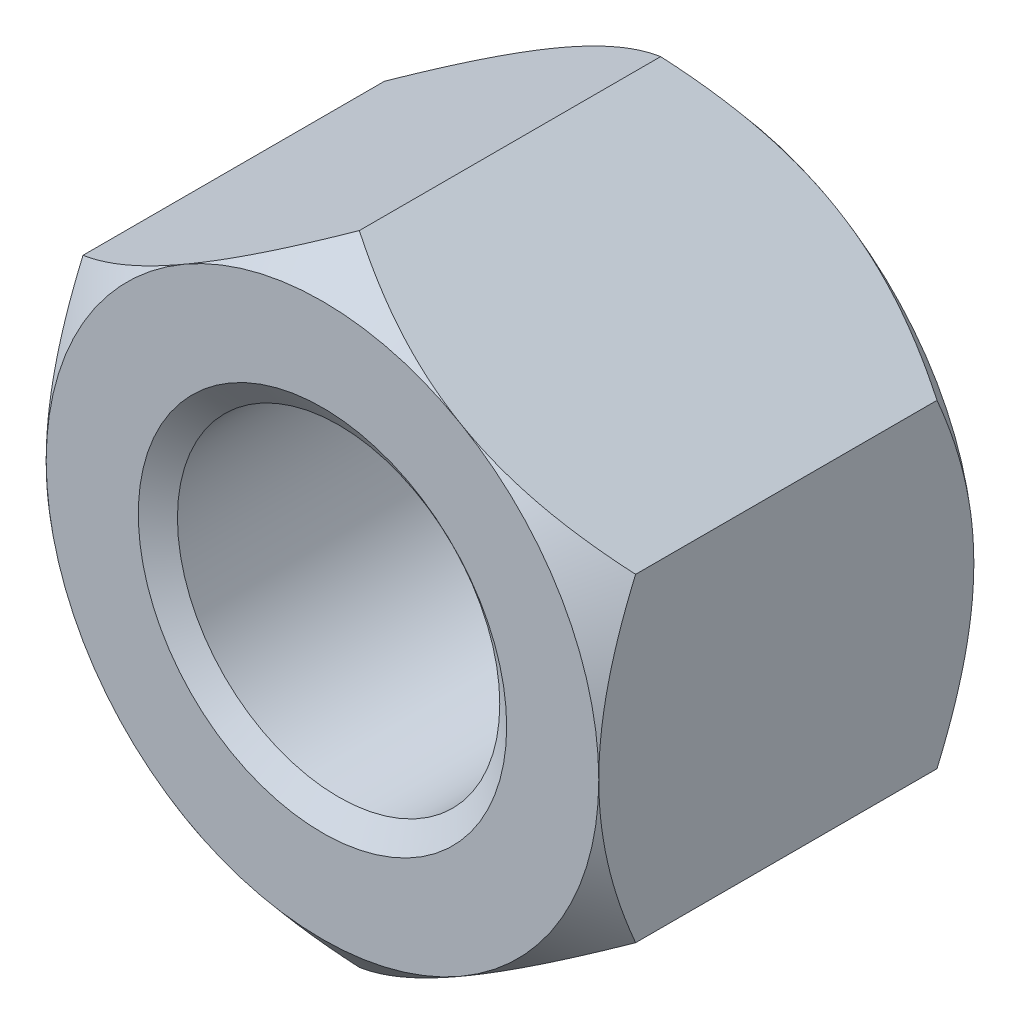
ISO-10303-21;
HEADER;
FILE_DESCRIPTION(('STEP AP214'),'2;1');
FILE_NAME('part.step','',(''),(''),'','','');
FILE_SCHEMA(('AUTOMOTIVE_DESIGN { 1 0 10303 214 1 1 1 1 }'));
ENDSEC;
DATA;
#1=APPLICATION_CONTEXT('core data for automotive mechanical design processes');
#2=APPLICATION_PROTOCOL_DEFINITION('international standard','automotive_design',2000,#1);
#3=PRODUCT_CONTEXT('',#1,'mechanical');
#4=PRODUCT('Part','Part','',(#3));
#5=PRODUCT_RELATED_PRODUCT_CATEGORY('part','',(#4));
#6=PRODUCT_DEFINITION_FORMATION('','',#4);
#7=PRODUCT_DEFINITION_CONTEXT('part definition',#1,'design');
#8=PRODUCT_DEFINITION('design','',#6,#7);
#9=PRODUCT_DEFINITION_SHAPE('','',#8);
#10=(LENGTH_UNIT() NAMED_UNIT(*) SI_UNIT(.MILLI.,.METRE.));
#11=(NAMED_UNIT(*) PLANE_ANGLE_UNIT() SI_UNIT($,.RADIAN.));
#12=(NAMED_UNIT(*) SI_UNIT($,.STERADIAN.) SOLID_ANGLE_UNIT());
#13=UNCERTAINTY_MEASURE_WITH_UNIT(LENGTH_MEASURE(1.E-05),#10,'distance_accuracy_value','');
#14=(GEOMETRIC_REPRESENTATION_CONTEXT(3) GLOBAL_UNCERTAINTY_ASSIGNED_CONTEXT((#13)) GLOBAL_UNIT_ASSIGNED_CONTEXT((#10,
#11,#12)) REPRESENTATION_CONTEXT('',''));
#15=CARTESIAN_POINT('',(0.,0.,0.));
#16=DIRECTION('',(0.,0.,1.));
#17=DIRECTION('',(1.,0.,0.));
#18=AXIS2_PLACEMENT_3D('',#15,#16,#17);
#19=CARTESIAN_POINT('',(0.,0.,-25.8572));
#20=DIRECTION('',(0.,0.,1.));
#21=DIRECTION('',(1.,0.,0.));
#22=AXIS2_PLACEMENT_3D('',#19,#20,#21);
#23=CYLINDRICAL_SURFACE('',#22,11.1125);
#24=CARTESIAN_POINT('',(0.,0.,-1.11157946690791));
#25=DIRECTION('',(0.,0.,1.));
#26=DIRECTION('',(1.,0.,0.));
#27=AXIS2_PLACEMENT_3D('',#24,#25,#26);
#28=CIRCLE('',#27,11.1125);
#29=CARTESIAN_POINT('',(11.1125,0.,-1.11157946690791));
#30=VERTEX_POINT('',#29);
#31=EDGE_CURVE('E173',#30,#30,#28,.F.);
#32=ORIENTED_EDGE('',*,*,#31,.F.);
#33=EDGE_LOOP('',(#32));
#34=FACE_BOUND('',#33,.T.);
#35=CARTESIAN_POINT('',(0.,0.,-24.7202205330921));
#36=DIRECTION('',(0.,0.,-1.));
#37=DIRECTION('',(-1.,0.,0.));
#38=AXIS2_PLACEMENT_3D('',#35,#36,#37);
#39=CIRCLE('',#38,11.1125);
#40=CARTESIAN_POINT('',(-11.1125,0.,-24.7202205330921));
#41=VERTEX_POINT('',#40);
#42=EDGE_CURVE('E38',#41,#41,#39,.F.);
#43=ORIENTED_EDGE('',*,*,#42,.F.);
#44=EDGE_LOOP('',(#43));
#45=FACE_BOUND('',#44,.T.);
#46=ADVANCED_FACE('F33',(#34,#45),#23,.F.);
#47=CARTESIAN_POINT('',(0.,21.9970452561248,-25.8572));
#48=DIRECTION('',(0.,0.,-1.));
#49=DIRECTION('',(-1.,0.,0.));
#50=AXIS2_PLACEMENT_3D('',#47,#48,#49);
#51=PLANE('',#50);
#52=CARTESIAN_POINT('',(0.,0.,-25.8572));
#53=DIRECTION('',(0.,0.,-1.));
#54=DIRECTION('',(-1.,0.,0.));
#55=AXIS2_PLACEMENT_3D('',#52,#53,#54);
#56=CIRCLE('',#55,19.05);
#57=CARTESIAN_POINT('',(-19.05,0.,-25.8572));
#58=VERTEX_POINT('',#57);
#59=CARTESIAN_POINT('',(-9.52500000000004,-16.4977839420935,-25.8572));
#60=VERTEX_POINT('',#59);
#61=EDGE_CURVE('E169',#58,#60,#56,.F.);
#62=ORIENTED_EDGE('',*,*,#61,.F.);
#63=CARTESIAN_POINT('',(-9.52500000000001,16.4977839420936,-25.8572));
#64=VERTEX_POINT('',#63);
#65=EDGE_CURVE('E151',#64,#58,#56,.F.);
#66=ORIENTED_EDGE('',*,*,#65,.F.);
#67=CARTESIAN_POINT('',(9.52500000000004,16.4977839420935,-25.8572));
#68=VERTEX_POINT('',#67);
#69=EDGE_CURVE('E168',#68,#64,#56,.F.);
#70=ORIENTED_EDGE('',*,*,#69,.F.);
#71=CARTESIAN_POINT('',(0.,0.,-25.8572));
#72=DIRECTION('',(0.,0.,1.));
#73=DIRECTION('',(1.,0.,0.));
#74=AXIS2_PLACEMENT_3D('',#71,#72,#73);
#75=CIRCLE('',#74,19.05);
#76=CARTESIAN_POINT('',(19.05,0.,-25.8572));
#77=VERTEX_POINT('',#76);
#78=EDGE_CURVE('E243',#77,#68,#75,.T.);
#79=ORIENTED_EDGE('',*,*,#78,.F.);
#80=CARTESIAN_POINT('',(9.525,-16.4977839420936,-25.8572));
#81=VERTEX_POINT('',#80);
#82=EDGE_CURVE('E359',#81,#77,#56,.F.);
#83=ORIENTED_EDGE('',*,*,#82,.F.);
#84=EDGE_CURVE('E363',#60,#81,#56,.F.);
#85=ORIENTED_EDGE('',*,*,#84,.F.);
#86=EDGE_LOOP('',(#62,#66,#70,#79,#83,#85));
#87=FACE_BOUND('',#86,.T.);
#88=CARTESIAN_POINT('',(0.,0.,-25.8572));
#89=DIRECTION('',(0.,0.,-1.));
#90=DIRECTION('',(-1.,0.,0.));
#91=AXIS2_PLACEMENT_3D('',#88,#89,#90);
#92=CIRCLE('',#91,12.7);
#93=CARTESIAN_POINT('',(-12.7,0.,-25.8572));
#94=VERTEX_POINT('',#93);
#95=EDGE_CURVE('E176',#94,#94,#92,.F.);
#96=ORIENTED_EDGE('',*,*,#95,.T.);
#97=EDGE_LOOP('',(#96));
#98=FACE_BOUND('',#97,.T.);
#99=ADVANCED_FACE('F296',(#87,#98),#51,.T.);
#100=CARTESIAN_POINT('',(0.,21.9970452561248,0.));
#101=DIRECTION('',(0.,0.,-1.));
#102=DIRECTION('',(-1.,0.,0.));
#103=AXIS2_PLACEMENT_3D('',#100,#101,#102);
#104=PLANE('',#103);
#105=CARTESIAN_POINT('',(0.,0.,0.));
#106=DIRECTION('',(0.,0.,-1.));
#107=DIRECTION('',(-1.,0.,0.));
#108=AXIS2_PLACEMENT_3D('',#105,#106,#107);
#109=CIRCLE('',#108,19.05);
#110=CARTESIAN_POINT('',(-19.05,0.,0.));
#111=VERTEX_POINT('',#110);
#112=CARTESIAN_POINT('',(-9.52500000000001,16.4977839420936,0.));
#113=VERTEX_POINT('',#112);
#114=EDGE_CURVE('E11',#111,#113,#109,.T.);
#115=ORIENTED_EDGE('',*,*,#114,.F.);
#116=CARTESIAN_POINT('',(-9.52500000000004,-16.4977839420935,0.));
#117=VERTEX_POINT('',#116);
#118=EDGE_CURVE('E45',#117,#111,#109,.T.);
#119=ORIENTED_EDGE('',*,*,#118,.F.);
#120=CARTESIAN_POINT('',(9.525,-16.4977839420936,0.));
#121=VERTEX_POINT('',#120);
#122=EDGE_CURVE('E172',#121,#117,#109,.T.);
#123=ORIENTED_EDGE('',*,*,#122,.F.);
#124=CARTESIAN_POINT('',(19.05,0.,0.));
#125=VERTEX_POINT('',#124);
#126=EDGE_CURVE('E350',#125,#121,#109,.T.);
#127=ORIENTED_EDGE('',*,*,#126,.F.);
#128=CARTESIAN_POINT('',(0.,0.,0.));
#129=DIRECTION('',(0.,0.,1.));
#130=DIRECTION('',(1.,0.,0.));
#131=AXIS2_PLACEMENT_3D('',#128,#129,#130);
#132=CIRCLE('',#131,19.05);
#133=CARTESIAN_POINT('',(9.52500000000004,16.4977839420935,0.));
#134=VERTEX_POINT('',#133);
#135=EDGE_CURVE('E127',#125,#134,#132,.T.);
#136=ORIENTED_EDGE('',*,*,#135,.T.);
#137=EDGE_CURVE('E43',#113,#134,#109,.T.);
#138=ORIENTED_EDGE('',*,*,#137,.F.);
#139=EDGE_LOOP('',(#115,#119,#123,#127,#136,#138));
#140=FACE_BOUND('',#139,.T.);
#141=CARTESIAN_POINT('',(0.,0.,0.));
#142=DIRECTION('',(0.,0.,1.));
#143=DIRECTION('',(1.,0.,0.));
#144=AXIS2_PLACEMENT_3D('',#141,#142,#143);
#145=CIRCLE('',#144,12.7);
#146=CARTESIAN_POINT('',(12.7,0.,0.));
#147=VERTEX_POINT('',#146);
#148=EDGE_CURVE('E175',#147,#147,#145,.T.);
#149=ORIENTED_EDGE('',*,*,#148,.F.);
#150=EDGE_LOOP('',(#149));
#151=FACE_BOUND('',#150,.T.);
#152=ADVANCED_FACE('F248',(#140,#151),#104,.F.);
#153=CARTESIAN_POINT('',(0.,21.9970452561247,-25.8572));
#154=DIRECTION('',(-0.5,0.866025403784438,0.));
#155=DIRECTION('',(-0.866025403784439,-0.5,0.));
#156=AXIS2_PLACEMENT_3D('',#153,#154,#155);
#157=PLANE('',#156);
#158=DIRECTION('',(0.,0.,1.));
#159=VECTOR('',#158,1.);
#160=CARTESIAN_POINT('',(-19.05,10.9985226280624,-25.8572));
#161=LINE('',#160,#159);
#162=CARTESIAN_POINT('',(-19.05,10.9985226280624,-23.3172));
#163=VERTEX_POINT('',#162);
#164=CARTESIAN_POINT('',(-19.05,10.9985226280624,-2.53999999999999));
#165=VERTEX_POINT('',#164);
#166=EDGE_CURVE('E163',#163,#165,#161,.T.);
#167=ORIENTED_EDGE('',*,*,#166,.T.);
#168=CARTESIAN_POINT('',(-19.0502,10.9984071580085,-2.54009952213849));
#169=CARTESIAN_POINT('',(-18.6766639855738,11.2140682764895,-2.35425451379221));
#170=CARTESIAN_POINT('',(-18.3004987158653,11.4312473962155,-2.17523809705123));
#171=CARTESIAN_POINT('',(-17.5425520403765,11.8688481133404,-1.83307180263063));
#172=CARTESIAN_POINT('',(-17.1607674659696,12.0892715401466,-1.66993130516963));
#173=CARTESIAN_POINT('',(-16.3897113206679,12.5344410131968,-1.3611684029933));
#174=CARTESIAN_POINT('',(-16.0004115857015,12.7592033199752,-1.21563910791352));
#175=CARTESIAN_POINT('',(-15.216398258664,13.2118536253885,-0.945694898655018));
#176=CARTESIAN_POINT('',(-14.8216855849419,13.4397410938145,-0.821276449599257));
#177=CARTESIAN_POINT('',(-14.0342916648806,13.8943431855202,-0.598191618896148));
#178=CARTESIAN_POINT('',(-13.6417004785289,14.1210058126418,-0.499104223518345));
#179=CARTESIAN_POINT('',(-12.852318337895,14.5767558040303,-0.326215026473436));
#180=CARTESIAN_POINT('',(-12.4555272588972,14.8058432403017,-0.252413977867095));
#181=CARTESIAN_POINT('',(-11.6597061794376,15.2653107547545,-0.132260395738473));
#182=CARTESIAN_POINT('',(-11.2606830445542,15.4956868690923,-0.0858477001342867));
#183=CARTESIAN_POINT('',(-10.4609191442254,15.9574307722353,-0.0216165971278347));
#184=CARTESIAN_POINT('',(-10.0601785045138,16.188798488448,-0.00379613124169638));
#185=CARTESIAN_POINT('',(-9.31450866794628,16.6193111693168,0.00225310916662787));
#186=CARTESIAN_POINT('',(-8.96959863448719,16.8184450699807,-0.00573407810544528));
#187=CARTESIAN_POINT('',(-8.28065896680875,17.2162045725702,-0.0430781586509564));
#188=CARTESIAN_POINT('',(-7.93662930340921,17.4148301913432,-0.0724343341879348));
#189=CARTESIAN_POINT('',(-7.25012577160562,17.8111831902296,-0.151878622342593));
#190=CARTESIAN_POINT('',(-6.90765324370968,18.0089097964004,-0.201982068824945));
#191=CARTESIAN_POINT('',(-6.22530999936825,18.4028608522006,-0.321846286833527));
#192=CARTESIAN_POINT('',(-5.88543932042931,18.5990852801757,-0.391607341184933));
#193=CARTESIAN_POINT('',(-5.20886184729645,18.9897074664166,-0.549433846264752));
#194=CARTESIAN_POINT('',(-4.87215552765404,19.1841049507,-0.637501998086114));
#195=CARTESIAN_POINT('',(-4.2023492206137,19.5708178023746,-0.830408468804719));
#196=CARTESIAN_POINT('',(-3.86924977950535,19.7631328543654,-0.935249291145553));
#197=CARTESIAN_POINT('',(-2.87609571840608,20.3365306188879,-1.27241570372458));
#198=CARTESIAN_POINT('',(-2.22175506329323,20.714314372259,-1.52748945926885));
#199=CARTESIAN_POINT('',(-1.30991685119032,21.240764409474,-1.92140953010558));
#200=CARTESIAN_POINT('',(-1.04568446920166,21.3933190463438,-2.04022275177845));
#201=CARTESIAN_POINT('',(-0.520499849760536,21.6965345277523,-2.28495691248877));
#202=CARTESIAN_POINT('',(-0.259540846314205,21.8471992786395,-2.41085847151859));
#203=CARTESIAN_POINT('',(0.000200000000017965,21.9971607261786,-2.54009952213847));
#204=B_SPLINE_CURVE_WITH_KNOTS('',3,(#168,#169,#170,#171,#172,#173,#174,#175,#176,#177,#178,
#179,#180,#181,#182,#183,#184,#185,#186,#187,#188,#189,#190,#191,#192,#193,#194,#195,#196,#197,
#198,#199,#200,#201,#202,#203),.UNSPECIFIED.,.F.,.F.,(4,2,2,2,2,2,2,2,2,2,2,2,2,2,2,2,2,4),(0.,
1.40903860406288,2.81890474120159,4.23592620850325,5.65271016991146,7.04413924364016,
8.43560975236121,9.82401222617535,11.212314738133,12.4067918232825,13.6012287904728,
14.7965501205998,15.9918886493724,17.1874036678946,18.3830972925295,20.7729660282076,
21.7551941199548,22.7348561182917),.UNSPECIFIED.);
#205=EDGE_CURVE('E132',#165,#113,#204,.T.);
#206=ORIENTED_EDGE('',*,*,#205,.T.);
#207=CARTESIAN_POINT('',(0.,21.9970452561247,-2.54));
#208=VERTEX_POINT('',#207);
#209=EDGE_CURVE('E52',#113,#208,#204,.T.);
#210=ORIENTED_EDGE('',*,*,#209,.T.);
#211=DIRECTION('',(0.,0.,1.));
#212=VECTOR('',#211,1.);
#213=CARTESIAN_POINT('',(0.,21.9970452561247,-25.8572));
#214=LINE('',#213,#212);
#215=CARTESIAN_POINT('',(0.,21.9970452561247,-23.3172));
#216=VERTEX_POINT('',#215);
#217=EDGE_CURVE('E148',#216,#208,#214,.T.);
#218=ORIENTED_EDGE('',*,*,#217,.F.);
#219=CARTESIAN_POINT('',(-19.0502,10.9984071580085,-23.3171004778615));
#220=CARTESIAN_POINT('',(-18.6766639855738,11.2140682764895,-23.5029454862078));
#221=CARTESIAN_POINT('',(-18.3004987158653,11.4312473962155,-23.6819619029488));
#222=CARTESIAN_POINT('',(-17.5425520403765,11.8688481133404,-24.0241281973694));
#223=CARTESIAN_POINT('',(-17.1607674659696,12.0892715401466,-24.1872686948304));
#224=CARTESIAN_POINT('',(-16.3897113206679,12.5344410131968,-24.4960315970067));
#225=CARTESIAN_POINT('',(-16.0004115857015,12.7592033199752,-24.6415608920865));
#226=CARTESIAN_POINT('',(-15.216398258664,13.2118536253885,-24.911505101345));
#227=CARTESIAN_POINT('',(-14.8216855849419,13.4397410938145,-25.0359235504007));
#228=CARTESIAN_POINT('',(-14.0342916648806,13.8943431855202,-25.2590083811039));
#229=CARTESIAN_POINT('',(-13.6417004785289,14.1210058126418,-25.3580957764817));
#230=CARTESIAN_POINT('',(-12.852318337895,14.5767558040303,-25.5309849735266));
#231=CARTESIAN_POINT('',(-12.4555272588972,14.8058432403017,-25.6047860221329));
#232=CARTESIAN_POINT('',(-11.6597061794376,15.2653107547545,-25.7249396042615));
#233=CARTESIAN_POINT('',(-11.2606830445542,15.4956868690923,-25.7713522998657));
#234=CARTESIAN_POINT('',(-10.4609191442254,15.9574307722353,-25.8355834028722));
#235=CARTESIAN_POINT('',(-10.0601785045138,16.188798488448,-25.8534038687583));
#236=CARTESIAN_POINT('',(-9.31450866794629,16.6193111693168,-25.8594531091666));
#237=CARTESIAN_POINT('',(-8.96959863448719,16.8184450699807,-25.8514659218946));
#238=CARTESIAN_POINT('',(-8.28065896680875,17.2162045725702,-25.814121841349));
#239=CARTESIAN_POINT('',(-7.93662930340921,17.4148301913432,-25.7847656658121));
#240=CARTESIAN_POINT('',(-7.25012577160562,17.8111831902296,-25.7053213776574));
#241=CARTESIAN_POINT('',(-6.90765324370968,18.0089097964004,-25.6552179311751));
#242=CARTESIAN_POINT('',(-6.22530999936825,18.4028608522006,-25.5353537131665));
#243=CARTESIAN_POINT('',(-5.88543932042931,18.5990852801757,-25.4655926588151));
#244=CARTESIAN_POINT('',(-5.20886184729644,18.9897074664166,-25.3077661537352));
#245=CARTESIAN_POINT('',(-4.87215552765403,19.1841049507,-25.2196980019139));
#246=CARTESIAN_POINT('',(-4.2023492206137,19.5708178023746,-25.0267915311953));
#247=CARTESIAN_POINT('',(-3.86924977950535,19.7631328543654,-24.9219507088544));
#248=CARTESIAN_POINT('',(-2.87609571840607,20.3365306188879,-24.5847842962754));
#249=CARTESIAN_POINT('',(-2.22175506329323,20.714314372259,-24.3297105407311));
#250=CARTESIAN_POINT('',(-1.30991685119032,21.240764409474,-23.9357904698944));
#251=CARTESIAN_POINT('',(-1.04568446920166,21.3933190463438,-23.8169772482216));
#252=CARTESIAN_POINT('',(-0.520499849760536,21.6965345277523,-23.5722430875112));
#253=CARTESIAN_POINT('',(-0.259540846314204,21.8471992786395,-23.4463415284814));
#254=CARTESIAN_POINT('',(0.000200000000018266,21.9971607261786,-23.3171004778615));
#255=B_SPLINE_CURVE_WITH_KNOTS('',3,(#219,#220,#221,#222,#223,#224,#225,#226,#227,#228,#229,
#230,#231,#232,#233,#234,#235,#236,#237,#238,#239,#240,#241,#242,#243,#244,#245,#246,#247,#248,
#249,#250,#251,#252,#253,#254),.UNSPECIFIED.,.F.,.F.,(4,2,2,2,2,2,2,2,2,2,2,2,2,2,2,2,2,4),(0.,
1.40903860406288,2.81890474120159,4.23592620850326,5.65271016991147,7.04413924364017,
8.43560975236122,9.82401222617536,11.212314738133,12.4067918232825,13.6012287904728,
14.7965501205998,15.9918886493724,17.1874036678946,18.3830972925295,20.7729660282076,
21.7551941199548,22.7348561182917),.UNSPECIFIED.);
#256=EDGE_CURVE('E166',#64,#216,#255,.T.);
#257=ORIENTED_EDGE('',*,*,#256,.F.);
#258=EDGE_CURVE('E258',#163,#64,#255,.T.);
#259=ORIENTED_EDGE('',*,*,#258,.F.);
#260=EDGE_LOOP('',(#167,#206,#210,#218,#257,#259));
#261=FACE_BOUND('',#260,.T.);
#262=ADVANCED_FACE('F35',(#261),#157,.T.);
#263=CARTESIAN_POINT('',(19.05,10.9985226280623,-25.8572));
#264=DIRECTION('',(0.500000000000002,0.866025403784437,0.));
#265=DIRECTION('',(-0.866025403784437,0.500000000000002,0.));
#266=AXIS2_PLACEMENT_3D('',#263,#264,#265);
#267=PLANE('',#266);
#268=ORIENTED_EDGE('',*,*,#217,.T.);
#269=CARTESIAN_POINT('',(-0.000199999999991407,21.9971607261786,-2.5400995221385));
#270=CARTESIAN_POINT('',(0.373336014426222,21.7814996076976,-2.35425451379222));
#271=CARTESIAN_POINT('',(0.74950128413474,21.5643204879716,-2.17523809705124));
#272=CARTESIAN_POINT('',(1.50744795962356,21.1267197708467,-1.83307180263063));
#273=CARTESIAN_POINT('',(1.88923253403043,20.9062963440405,-1.66993130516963));
#274=CARTESIAN_POINT('',(2.66028867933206,20.4611268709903,-1.3611684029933));
#275=CARTESIAN_POINT('',(3.04958841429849,20.2363645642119,-1.21563910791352));
#276=CARTESIAN_POINT('',(3.83360174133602,19.7837142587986,-0.945694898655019));
#277=CARTESIAN_POINT('',(4.22831441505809,19.5558267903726,-0.821276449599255));
#278=CARTESIAN_POINT('',(5.01570833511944,19.1012246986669,-0.598191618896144));
#279=CARTESIAN_POINT('',(5.4082995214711,18.8745620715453,-0.499104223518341));
#280=CARTESIAN_POINT('',(6.197681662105,18.4188120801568,-0.32621502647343));
#281=CARTESIAN_POINT('',(6.59447274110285,18.1897246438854,-0.252413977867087));
#282=CARTESIAN_POINT('',(7.39029382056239,17.7302571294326,-0.132260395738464));
#283=CARTESIAN_POINT('',(7.78931695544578,17.4998810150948,-0.0858477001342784));
#284=CARTESIAN_POINT('',(8.58908085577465,17.0381371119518,-0.0216165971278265));
#285=CARTESIAN_POINT('',(8.9898214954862,16.8067693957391,-0.00379613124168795));
#286=CARTESIAN_POINT('',(9.73549133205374,16.3762567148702,0.00225310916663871));
#287=CARTESIAN_POINT('',(10.0804013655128,16.1771228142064,-0.00573407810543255));
#288=CARTESIAN_POINT('',(10.7693410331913,15.7793633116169,-0.0430781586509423));
#289=CARTESIAN_POINT('',(11.1133706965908,15.5807376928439,-0.0724343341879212));
#290=CARTESIAN_POINT('',(11.7998742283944,15.1843846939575,-0.151878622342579));
#291=CARTESIAN_POINT('',(12.1423467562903,14.9866580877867,-0.201982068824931));
#292=CARTESIAN_POINT('',(12.8246900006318,14.5927070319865,-0.321846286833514));
#293=CARTESIAN_POINT('',(13.1645606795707,14.3964826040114,-0.391607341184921));
#294=CARTESIAN_POINT('',(13.8411381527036,14.0058604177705,-0.549433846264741));
#295=CARTESIAN_POINT('',(14.177844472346,13.8114629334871,-0.637501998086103));
#296=CARTESIAN_POINT('',(14.8476507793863,13.4247500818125,-0.830408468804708));
#297=CARTESIAN_POINT('',(15.1807502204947,13.2324350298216,-0.935249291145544));
#298=CARTESIAN_POINT('',(16.173904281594,12.6590372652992,-1.27241570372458));
#299=CARTESIAN_POINT('',(16.8282449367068,12.2812535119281,-1.52748945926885));
#300=CARTESIAN_POINT('',(17.7400831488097,11.7548034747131,-1.92140953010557));
#301=CARTESIAN_POINT('',(18.0043155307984,11.6022488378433,-2.04022275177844));
#302=CARTESIAN_POINT('',(18.5295001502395,11.2990333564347,-2.28495691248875));
#303=CARTESIAN_POINT('',(18.7904591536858,11.1483686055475,-2.41085847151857));
#304=CARTESIAN_POINT('',(19.0502,10.9984071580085,-2.54009952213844));
#305=B_SPLINE_CURVE_WITH_KNOTS('',3,(#269,#270,#271,#272,#273,#274,#275,#276,#277,#278,#279,
#280,#281,#282,#283,#284,#285,#286,#287,#288,#289,#290,#291,#292,#293,#294,#295,#296,#297,#298,
#299,#300,#301,#302,#303,#304),.UNSPECIFIED.,.F.,.F.,(4,2,2,2,2,2,2,2,2,2,2,2,2,2,2,2,2,4),(0.,
1.40903860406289,2.81890474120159,4.23592620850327,5.65271016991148,7.04413924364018,
8.43560975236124,9.82401222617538,11.212314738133,12.4067918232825,13.6012287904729,
14.7965501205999,15.9918886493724,17.1874036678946,18.3830972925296,20.7729660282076,
21.7551941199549,22.7348561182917),.UNSPECIFIED.);
#306=EDGE_CURVE('E142',#208,#134,#305,.T.);
#307=ORIENTED_EDGE('',*,*,#306,.T.);
#308=CARTESIAN_POINT('',(19.05,10.9985226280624,-2.54));
#309=VERTEX_POINT('',#308);
#310=EDGE_CURVE('E59',#134,#309,#305,.T.);
#311=ORIENTED_EDGE('',*,*,#310,.T.);
#312=DIRECTION('',(0.,0.,1.));
#313=VECTOR('',#312,1.);
#314=CARTESIAN_POINT('',(19.05,10.9985226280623,-25.8572));
#315=LINE('',#314,#313);
#316=CARTESIAN_POINT('',(19.05,10.9985226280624,-23.3172));
#317=VERTEX_POINT('',#316);
#318=EDGE_CURVE('E141',#317,#309,#315,.T.);
#319=ORIENTED_EDGE('',*,*,#318,.F.);
#320=CARTESIAN_POINT('',(-0.000199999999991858,21.9971607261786,-23.3171004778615));
#321=CARTESIAN_POINT('',(0.373336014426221,21.7814996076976,-23.5029454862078));
#322=CARTESIAN_POINT('',(0.74950128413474,21.5643204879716,-23.6819619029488));
#323=CARTESIAN_POINT('',(1.50744795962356,21.1267197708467,-24.0241281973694));
#324=CARTESIAN_POINT('',(1.88923253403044,20.9062963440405,-24.1872686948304));
#325=CARTESIAN_POINT('',(2.66028867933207,20.4611268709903,-24.4960315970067));
#326=CARTESIAN_POINT('',(3.0495884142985,20.2363645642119,-24.6415608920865));
#327=CARTESIAN_POINT('',(3.83360174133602,19.7837142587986,-24.911505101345));
#328=CARTESIAN_POINT('',(4.22831441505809,19.5558267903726,-25.0359235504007));
#329=CARTESIAN_POINT('',(5.01570833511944,19.1012246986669,-25.2590083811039));
#330=CARTESIAN_POINT('',(5.40829952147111,18.8745620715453,-25.3580957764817));
#331=CARTESIAN_POINT('',(6.197681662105,18.4188120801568,-25.5309849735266));
#332=CARTESIAN_POINT('',(6.59447274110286,18.1897246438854,-25.6047860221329));
#333=CARTESIAN_POINT('',(7.3902938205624,17.7302571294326,-25.7249396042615));
#334=CARTESIAN_POINT('',(7.78931695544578,17.4998810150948,-25.7713522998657));
#335=CARTESIAN_POINT('',(8.58908085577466,17.0381371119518,-25.8355834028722));
#336=CARTESIAN_POINT('',(8.9898214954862,16.8067693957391,-25.8534038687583));
#337=CARTESIAN_POINT('',(9.73549133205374,16.3762567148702,-25.8594531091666));
#338=CARTESIAN_POINT('',(10.0804013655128,16.1771228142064,-25.8514659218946));
#339=CARTESIAN_POINT('',(10.7693410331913,15.7793633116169,-25.8141218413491));
#340=CARTESIAN_POINT('',(11.1133706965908,15.5807376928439,-25.7847656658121));
#341=CARTESIAN_POINT('',(11.7998742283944,15.1843846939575,-25.7053213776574));
#342=CARTESIAN_POINT('',(12.1423467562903,14.9866580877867,-25.6552179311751));
#343=CARTESIAN_POINT('',(12.8246900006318,14.5927070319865,-25.5353537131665));
#344=CARTESIAN_POINT('',(13.1645606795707,14.3964826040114,-25.4655926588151));
#345=CARTESIAN_POINT('',(13.8411381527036,14.0058604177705,-25.3077661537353));
#346=CARTESIAN_POINT('',(14.177844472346,13.8114629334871,-25.2196980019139));
#347=CARTESIAN_POINT('',(14.8476507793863,13.4247500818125,-25.0267915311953));
#348=CARTESIAN_POINT('',(15.1807502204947,13.2324350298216,-24.9219507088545));
#349=CARTESIAN_POINT('',(16.173904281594,12.6590372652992,-24.5847842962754));
#350=CARTESIAN_POINT('',(16.8282449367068,12.2812535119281,-24.3297105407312));
#351=CARTESIAN_POINT('',(17.7400831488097,11.7548034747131,-23.9357904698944));
#352=CARTESIAN_POINT('',(18.0043155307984,11.6022488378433,-23.8169772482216));
#353=CARTESIAN_POINT('',(18.5295001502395,11.2990333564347,-23.5722430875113));
#354=CARTESIAN_POINT('',(18.7904591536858,11.1483686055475,-23.4463415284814));
#355=CARTESIAN_POINT('',(19.0502,10.9984071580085,-23.3171004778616));
#356=B_SPLINE_CURVE_WITH_KNOTS('',3,(#320,#321,#322,#323,#324,#325,#326,#327,#328,#329,#330,
#331,#332,#333,#334,#335,#336,#337,#338,#339,#340,#341,#342,#343,#344,#345,#346,#347,#348,#349,
#350,#351,#352,#353,#354,#355),.UNSPECIFIED.,.F.,.F.,(4,2,2,2,2,2,2,2,2,2,2,2,2,2,2,2,2,4),(0.,
1.40903860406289,2.8189047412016,4.23592620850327,5.65271016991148,7.04413924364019,
8.43560975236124,9.82401222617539,11.212314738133,12.4067918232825,13.6012287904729,
14.7965501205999,15.9918886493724,17.1874036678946,18.3830972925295,20.7729660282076,
21.7551941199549,22.7348561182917),.UNSPECIFIED.);
#357=EDGE_CURVE('E252',#68,#317,#356,.T.);
#358=ORIENTED_EDGE('',*,*,#357,.F.);
#359=EDGE_CURVE('E257',#216,#68,#356,.T.);
#360=ORIENTED_EDGE('',*,*,#359,.F.);
#361=EDGE_LOOP('',(#268,#307,#311,#319,#358,#360));
#362=FACE_BOUND('',#361,.T.);
#363=ADVANCED_FACE('F139',(#362),#267,.T.);
#364=CARTESIAN_POINT('',(19.05,10.9985226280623,-25.8572));
#365=DIRECTION('',(-1.,0.,0.));
#366=DIRECTION('',(0.,-1.,0.));
#367=AXIS2_PLACEMENT_3D('',#364,#365,#366);
#368=PLANE('',#367);
#369=CARTESIAN_POINT('',(19.05,-24.3459075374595,-10.2246542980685));
#370=CARTESIAN_POINT('',(19.05,-24.037951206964,-10.015623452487));
#371=CARTESIAN_POINT('',(19.05,-23.729299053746,-9.80761844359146));
#372=CARTESIAN_POINT('',(19.05,-23.1104804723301,-9.39386332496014));
#373=CARTESIAN_POINT('',(19.05,-22.8003140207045,-9.18811325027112));
#374=CARTESIAN_POINT('',(19.05,-21.8672452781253,-8.57447554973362));
#375=CARTESIAN_POINT('',(19.05,-21.2419006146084,-8.17028689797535));
#376=CARTESIAN_POINT('',(19.05,-19.9791742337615,-7.37102642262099));
#377=CARTESIAN_POINT('',(19.05,-19.3417386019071,-6.97603958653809));
#378=CARTESIAN_POINT('',(19.05,-18.0579249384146,-6.20092021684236));
#379=CARTESIAN_POINT('',(19.05,-17.4115474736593,-5.82078674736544));
#380=CARTESIAN_POINT('',(19.05,-16.0729603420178,-5.05871710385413));
#381=CARTESIAN_POINT('',(19.05,-15.3801665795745,-4.67780184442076));
#382=CARTESIAN_POINT('',(19.05,-13.9808571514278,-3.94162489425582));
#383=CARTESIAN_POINT('',(19.05,-13.274339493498,-3.58636696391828));
#384=CARTESIAN_POINT('',(19.05,-11.8476157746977,-2.9095001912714));
#385=CARTESIAN_POINT('',(19.05,-11.1274521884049,-2.58780242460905));
#386=CARTESIAN_POINT('',(19.05,-9.67001173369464,-1.98596610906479));
#387=CARTESIAN_POINT('',(19.05,-8.93274207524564,-1.70581040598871));
#388=CARTESIAN_POINT('',(19.05,-7.82393239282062,-1.32849768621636));
#389=CARTESIAN_POINT('',(19.05,-7.45917391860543,-1.2112907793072));
#390=CARTESIAN_POINT('',(19.05,-6.72549523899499,-0.990662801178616));
#391=CARTESIAN_POINT('',(19.05,-6.35657515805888,-0.887241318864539));
#392=CARTESIAN_POINT('',(19.05,-5.61476663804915,-0.695590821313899));
#393=CARTESIAN_POINT('',(19.05,-5.24187791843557,-0.607362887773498));
#394=CARTESIAN_POINT('',(19.05,-4.49256590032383,-0.447495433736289));
#395=CARTESIAN_POINT('',(19.05,-4.11614282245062,-0.375854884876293));
#396=CARTESIAN_POINT('',(19.05,-3.36734414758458,-0.251582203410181));
#397=CARTESIAN_POINT('',(19.05,-2.99502332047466,-0.198621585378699));
#398=CARTESIAN_POINT('',(19.05,-2.24823631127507,-0.110872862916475));
#399=CARTESIAN_POINT('',(19.05,-1.8737701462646,-0.0760846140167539));
#400=CARTESIAN_POINT('',(19.05,-1.12358758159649,-0.0253762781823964));
#401=CARTESIAN_POINT('',(19.05,-0.747871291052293,-0.00945458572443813));
#402=CARTESIAN_POINT('',(19.05,0.00388322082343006,0.0031944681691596));
#403=CARTESIAN_POINT('',(19.05,0.379921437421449,-7.78928581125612E-05));
#404=CARTESIAN_POINT('',(19.05,1.10621604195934,-0.0248865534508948));
#405=CARTESIAN_POINT('',(19.05,1.4565154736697,-0.04518729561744));
#406=CARTESIAN_POINT('',(19.05,2.15577979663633,-0.102073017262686));
#407=CARTESIAN_POINT('',(19.05,2.50474470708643,-0.138657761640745));
#408=CARTESIAN_POINT('',(19.05,3.20068004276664,-0.227487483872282));
#409=CARTESIAN_POINT('',(19.05,3.54765038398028,-0.279733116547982));
#410=CARTESIAN_POINT('',(19.05,4.23902459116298,-0.399049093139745));
#411=CARTESIAN_POINT('',(19.05,4.58342842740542,-0.466119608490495));
#412=CARTESIAN_POINT('',(19.05,5.27636069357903,-0.615642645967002));
#413=CARTESIAN_POINT('',(19.05,5.62482618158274,-0.698385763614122));
#414=CARTESIAN_POINT('',(19.05,6.31831750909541,-0.87716901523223));
#415=CARTESIAN_POINT('',(19.05,6.66334331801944,-0.973209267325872));
#416=CARTESIAN_POINT('',(19.05,7.34968342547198,-1.17740366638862));
#417=CARTESIAN_POINT('',(19.05,7.6909986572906,-1.2855546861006));
#418=CARTESIAN_POINT('',(19.05,8.36991903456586,-1.5128522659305));
#419=CARTESIAN_POINT('',(19.05,8.70752428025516,-1.63199852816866));
#420=CARTESIAN_POINT('',(19.05,9.65791189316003,-1.98326904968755));
#421=CARTESIAN_POINT('',(19.05,10.266402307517,-2.22705167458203));
#422=CARTESIAN_POINT('',(19.05,11.4718022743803,-2.74189715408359));
#423=CARTESIAN_POINT('',(19.05,12.0687084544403,-3.01296781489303));
#424=CARTESIAN_POINT('',(19.05,13.2524946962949,-3.57769190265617));
#425=CARTESIAN_POINT('',(19.05,13.8393630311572,-3.87136979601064));
#426=CARTESIAN_POINT('',(19.05,15.0034964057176,-4.47697100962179));
#427=CARTESIAN_POINT('',(19.05,15.5807622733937,-4.7888927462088));
#428=CARTESIAN_POINT('',(19.05,16.7303491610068,-5.42969693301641));
#429=CARTESIAN_POINT('',(19.05,17.3026192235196,-5.75867048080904));
#430=CARTESIAN_POINT('',(19.05,18.4397284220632,-6.42920514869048));
#431=CARTESIAN_POINT('',(19.05,19.0045674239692,-6.77076649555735));
#432=CARTESIAN_POINT('',(19.05,20.1274427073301,-7.46417938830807));
#433=CARTESIAN_POINT('',(19.05,20.6854826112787,-7.81602508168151));
#434=CARTESIAN_POINT('',(19.05,21.7959051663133,-8.52850677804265));
#435=CARTESIAN_POINT('',(19.05,22.3482878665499,-8.88914270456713));
#436=CARTESIAN_POINT('',(19.05,23.3937948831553,-9.5818625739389));
#437=CARTESIAN_POINT('',(19.05,23.8873828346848,-9.91324794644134));
#438=CARTESIAN_POINT('',(19.05,24.8710024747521,-10.5812589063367));
#439=CARTESIAN_POINT('',(19.05,25.3610341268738,-10.9178845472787));
#440=CARTESIAN_POINT('',(19.05,26.8265263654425,-11.9346577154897));
#441=CARTESIAN_POINT('',(19.05,27.797263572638,-12.6216210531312));
#442=CARTESIAN_POINT('',(19.05,29.2394294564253,-13.657937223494));
#443=CARTESIAN_POINT('',(19.05,29.7146709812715,-14.0020163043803));
#444=CARTESIAN_POINT('',(19.05,30.6629492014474,-14.6932049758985));
#445=CARTESIAN_POINT('',(19.05,31.1359858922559,-15.0403145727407));
#446=CARTESIAN_POINT('',(19.05,32.0799512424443,-15.73712786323));
#447=CARTESIAN_POINT('',(19.05,32.5508804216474,-16.0868308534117));
#448=CARTESIAN_POINT('',(19.05,33.4909382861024,-16.7886392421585));
#449=CARTESIAN_POINT('',(19.05,33.9600669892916,-17.1407446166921));
#450=CARTESIAN_POINT('',(19.05,34.4283915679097,-17.4939138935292));
#451=B_SPLINE_CURVE_WITH_KNOTS('',3,(#369,#370,#371,#372,#373,#374,#375,#376,#377,#378,#379,
#380,#381,#382,#383,#384,#385,#386,#387,#388,#389,#390,#391,#392,#393,#394,#395,#396,#397,#398,
#399,#400,#401,#402,#403,#404,#405,#406,#407,#408,#409,#410,#411,#412,#413,#414,#415,#416,#417,
#418,#419,#420,#421,#422,#423,#424,#425,#426,#427,#428,#429,#430,#431,#432,#433,#434,#435,#436,
#437,#438,#439,#440,#441,#442,#443,#444,#445,#446,#447,#448,#449,#450),.UNSPECIFIED.,.F.,.F.,(4,
2,2,2,2,2,2,2,2,2,2,2,2,2,2,2,2,2,2,2,2,2,2,2,2,2,2,2,2,2,2,2,2,2,2,2,2,2,2,2,4),(0.,
1.11658874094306,2.23319481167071,4.46686783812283,6.71638233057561,8.965754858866,
11.3371532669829,13.7088985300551,16.0741906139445,18.4385032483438,19.5876623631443,
20.7367872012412,21.8859938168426,23.0351291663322,24.1629107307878,25.2906833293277,
26.4183599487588,27.5460202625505,28.5982971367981,29.6505588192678,30.7028645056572,
31.7551823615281,32.8293606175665,33.9035484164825,34.9774594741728,36.0513414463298,
38.0169695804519,39.9831616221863,41.9515123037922,43.9196923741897,45.8997653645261,
47.8798740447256,49.8588770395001,51.8378628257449,53.6213628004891,55.4048810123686,
58.9723524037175,60.732517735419,62.492686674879,64.2523944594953,66.0120846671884),.UNSPECIFIED.);
#452=CARTESIAN_POINT('',(19.05,-10.9985226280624,-2.54));
#453=VERTEX_POINT('',#452);
#454=EDGE_CURVE('E134',#453,#125,#451,.T.);
#455=ORIENTED_EDGE('',*,*,#454,.F.);
#456=DIRECTION('',(0.,0.,1.));
#457=VECTOR('',#456,1.);
#458=CARTESIAN_POINT('',(19.05,-10.9985226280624,-25.8572));
#459=LINE('',#458,#457);
#460=CARTESIAN_POINT('',(19.05,-10.9985226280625,-23.3172));
#461=VERTEX_POINT('',#460);
#462=EDGE_CURVE('E149',#461,#453,#459,.T.);
#463=ORIENTED_EDGE('',*,*,#462,.F.);
#464=CARTESIAN_POINT('',(19.05,-24.3459075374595,-15.6325457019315));
#465=CARTESIAN_POINT('',(19.05,-24.037951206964,-15.841576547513));
#466=CARTESIAN_POINT('',(19.05,-23.729299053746,-16.0495815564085));
#467=CARTESIAN_POINT('',(19.05,-23.1104804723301,-16.4633366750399));
#468=CARTESIAN_POINT('',(19.05,-22.8003140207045,-16.6690867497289));
#469=CARTESIAN_POINT('',(19.05,-21.8672452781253,-17.2827244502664));
#470=CARTESIAN_POINT('',(19.05,-21.2419006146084,-17.6869131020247));
#471=CARTESIAN_POINT('',(19.05,-19.9791742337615,-18.486173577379));
#472=CARTESIAN_POINT('',(19.05,-19.3417386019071,-18.8811604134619));
#473=CARTESIAN_POINT('',(19.05,-18.0579249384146,-19.6562797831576));
#474=CARTESIAN_POINT('',(19.05,-17.4115474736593,-20.0364132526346));
#475=CARTESIAN_POINT('',(19.05,-16.0729603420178,-20.7984828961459));
#476=CARTESIAN_POINT('',(19.05,-15.3801665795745,-21.1793981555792));
#477=CARTESIAN_POINT('',(19.05,-13.9808571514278,-21.9155751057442));
#478=CARTESIAN_POINT('',(19.05,-13.274339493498,-22.2708330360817));
#479=CARTESIAN_POINT('',(19.05,-11.8476157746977,-22.9476998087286));
#480=CARTESIAN_POINT('',(19.05,-11.1274521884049,-23.2693975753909));
#481=CARTESIAN_POINT('',(19.05,-9.67001173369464,-23.8712338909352));
#482=CARTESIAN_POINT('',(19.05,-8.93274207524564,-24.1513895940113));
#483=CARTESIAN_POINT('',(19.05,-7.82393239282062,-24.5287023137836));
#484=CARTESIAN_POINT('',(19.05,-7.45917391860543,-24.6459092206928));
#485=CARTESIAN_POINT('',(19.05,-6.72549523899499,-24.8665371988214));
#486=CARTESIAN_POINT('',(19.05,-6.35657515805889,-24.9699586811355));
#487=CARTESIAN_POINT('',(19.05,-5.61476663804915,-25.1616091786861));
#488=CARTESIAN_POINT('',(19.05,-5.24187791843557,-25.2498371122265));
#489=CARTESIAN_POINT('',(19.05,-4.49256590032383,-25.4097045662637));
#490=CARTESIAN_POINT('',(19.05,-4.11614282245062,-25.4813451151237));
#491=CARTESIAN_POINT('',(19.05,-3.36734414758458,-25.6056177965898));
#492=CARTESIAN_POINT('',(19.05,-2.99502332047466,-25.6585784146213));
#493=CARTESIAN_POINT('',(19.05,-2.24823631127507,-25.7463271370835));
#494=CARTESIAN_POINT('',(19.05,-1.8737701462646,-25.7811153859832));
#495=CARTESIAN_POINT('',(19.05,-1.12358758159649,-25.8318237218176));
#496=CARTESIAN_POINT('',(19.05,-0.747871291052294,-25.8477454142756));
#497=CARTESIAN_POINT('',(19.05,0.00388322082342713,-25.8603944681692));
#498=CARTESIAN_POINT('',(19.05,0.379921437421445,-25.8571221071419));
#499=CARTESIAN_POINT('',(19.05,1.10621604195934,-25.8323134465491));
#500=CARTESIAN_POINT('',(19.05,1.45651547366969,-25.8120127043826));
#501=CARTESIAN_POINT('',(19.05,2.15577979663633,-25.7551269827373));
#502=CARTESIAN_POINT('',(19.05,2.50474470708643,-25.7185422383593));
#503=CARTESIAN_POINT('',(19.05,3.20068004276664,-25.6297125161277));
#504=CARTESIAN_POINT('',(19.05,3.54765038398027,-25.577466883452));
#505=CARTESIAN_POINT('',(19.05,4.23902459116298,-25.4581509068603));
#506=CARTESIAN_POINT('',(19.05,4.58342842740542,-25.3910803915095));
#507=CARTESIAN_POINT('',(19.05,5.27636069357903,-25.241557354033));
#508=CARTESIAN_POINT('',(19.05,5.62482618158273,-25.1588142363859));
#509=CARTESIAN_POINT('',(19.05,6.31831750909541,-24.9800309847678));
#510=CARTESIAN_POINT('',(19.05,6.66334331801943,-24.8839907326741));
#511=CARTESIAN_POINT('',(19.05,7.34968342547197,-24.6797963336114));
#512=CARTESIAN_POINT('',(19.05,7.69099865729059,-24.5716453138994));
#513=CARTESIAN_POINT('',(19.05,8.36991903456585,-24.3443477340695));
#514=CARTESIAN_POINT('',(19.05,8.70752428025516,-24.2252014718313));
#515=CARTESIAN_POINT('',(19.05,9.65791189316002,-23.8739309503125));
#516=CARTESIAN_POINT('',(19.05,10.266402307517,-23.630148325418));
#517=CARTESIAN_POINT('',(19.05,11.4718022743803,-23.1153028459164));
#518=CARTESIAN_POINT('',(19.05,12.0687084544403,-22.844232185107));
#519=CARTESIAN_POINT('',(19.05,13.2524946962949,-22.2795080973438));
#520=CARTESIAN_POINT('',(19.05,13.8393630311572,-21.9858302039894));
#521=CARTESIAN_POINT('',(19.05,15.0034964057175,-21.3802289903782));
#522=CARTESIAN_POINT('',(19.05,15.5807622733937,-21.0683072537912));
#523=CARTESIAN_POINT('',(19.05,16.7303491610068,-20.4275030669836));
#524=CARTESIAN_POINT('',(19.05,17.3026192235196,-20.098529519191));
#525=CARTESIAN_POINT('',(19.05,18.4397284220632,-19.4279948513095));
#526=CARTESIAN_POINT('',(19.05,19.0045674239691,-19.0864335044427));
#527=CARTESIAN_POINT('',(19.05,20.12744270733,-18.3930206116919));
#528=CARTESIAN_POINT('',(19.05,20.6854826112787,-18.0411749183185));
#529=CARTESIAN_POINT('',(19.05,21.7959051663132,-17.3286932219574));
#530=CARTESIAN_POINT('',(19.05,22.3482878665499,-16.9680572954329));
#531=CARTESIAN_POINT('',(19.05,23.3937948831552,-16.2753374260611));
#532=CARTESIAN_POINT('',(19.05,23.8873828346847,-15.9439520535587));
#533=CARTESIAN_POINT('',(19.05,24.871002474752,-15.2759410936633));
#534=CARTESIAN_POINT('',(19.05,25.3610341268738,-14.9393154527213));
#535=CARTESIAN_POINT('',(19.05,26.8265263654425,-13.9225422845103));
#536=CARTESIAN_POINT('',(19.05,27.797263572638,-13.2355789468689));
#537=CARTESIAN_POINT('',(19.05,29.2394294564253,-12.199262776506));
#538=CARTESIAN_POINT('',(19.05,29.7146709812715,-11.8551836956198));
#539=CARTESIAN_POINT('',(19.05,30.6629492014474,-11.1639950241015));
#540=CARTESIAN_POINT('',(19.05,31.1359858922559,-10.8168854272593));
#541=CARTESIAN_POINT('',(19.05,32.0799512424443,-10.12007213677));
#542=CARTESIAN_POINT('',(19.05,32.5508804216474,-9.77036914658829));
#543=CARTESIAN_POINT('',(19.05,33.4909382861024,-9.06856075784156));
#544=CARTESIAN_POINT('',(19.05,33.9600669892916,-8.71645538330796));
#545=CARTESIAN_POINT('',(19.05,34.4283915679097,-8.36328610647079));
#546=B_SPLINE_CURVE_WITH_KNOTS('',3,(#464,#465,#466,#467,#468,#469,#470,#471,#472,#473,#474,
#475,#476,#477,#478,#479,#480,#481,#482,#483,#484,#485,#486,#487,#488,#489,#490,#491,#492,#493,
#494,#495,#496,#497,#498,#499,#500,#501,#502,#503,#504,#505,#506,#507,#508,#509,#510,#511,#512,
#513,#514,#515,#516,#517,#518,#519,#520,#521,#522,#523,#524,#525,#526,#527,#528,#529,#530,#531,
#532,#533,#534,#535,#536,#537,#538,#539,#540,#541,#542,#543,#544,#545),.UNSPECIFIED.,.F.,.F.,(4,
2,2,2,2,2,2,2,2,2,2,2,2,2,2,2,2,2,2,2,2,2,2,2,2,2,2,2,2,2,2,2,2,2,2,2,2,2,2,2,4),(0.,
1.11658874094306,2.23319481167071,4.46686783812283,6.71638233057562,8.96575485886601,
11.3371532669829,13.7088985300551,16.0741906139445,18.4385032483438,19.5876623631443,
20.7367872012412,21.8859938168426,23.0351291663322,24.1629107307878,25.2906833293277,
26.4183599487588,27.5460202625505,28.5982971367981,29.6505588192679,30.7028645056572,
31.7551823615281,32.8293606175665,33.9035484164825,34.9774594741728,36.0513414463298,
38.0169695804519,39.9831616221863,41.9515123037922,43.9196923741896,45.8997653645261,
47.8798740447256,49.8588770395,51.8378628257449,53.621362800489,55.4048810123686,
58.9723524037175,60.732517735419,62.492686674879,64.2523944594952,66.0120846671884),.UNSPECIFIED.);
#547=EDGE_CURVE('E264',#461,#77,#546,.T.);
#548=ORIENTED_EDGE('',*,*,#547,.T.);
#549=EDGE_CURVE('E147',#77,#317,#546,.T.);
#550=ORIENTED_EDGE('',*,*,#549,.T.);
#551=ORIENTED_EDGE('',*,*,#318,.T.);
#552=EDGE_CURVE('E124',#125,#309,#451,.T.);
#553=ORIENTED_EDGE('',*,*,#552,.F.);
#554=EDGE_LOOP('',(#455,#463,#548,#550,#551,#553));
#555=FACE_BOUND('',#554,.T.);
#556=ADVANCED_FACE('F145',(#555),#368,.F.);
#557=CARTESIAN_POINT('',(0.,-21.9970452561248,-25.8572));
#558=DIRECTION('',(0.5,-0.866025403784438,0.));
#559=DIRECTION('',(0.866025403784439,0.5,0.));
#560=AXIS2_PLACEMENT_3D('',#557,#558,#559);
#561=PLANE('',#560);
#562=ORIENTED_EDGE('',*,*,#462,.T.);
#563=CARTESIAN_POINT('',(19.0502,-10.9984071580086,-2.54009952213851));
#564=CARTESIAN_POINT('',(18.6766639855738,-11.2140682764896,-2.35425451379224));
#565=CARTESIAN_POINT('',(18.3004987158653,-11.4312473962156,-2.17523809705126));
#566=CARTESIAN_POINT('',(17.5425520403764,-11.8688481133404,-1.83307180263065));
#567=CARTESIAN_POINT('',(17.1607674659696,-12.0892715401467,-1.66993130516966));
#568=CARTESIAN_POINT('',(16.3897113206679,-12.5344410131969,-1.36116840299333));
#569=CARTESIAN_POINT('',(16.0004115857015,-12.7592033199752,-1.21563910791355));
#570=CARTESIAN_POINT('',(15.216398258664,-13.2118536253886,-0.945694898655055));
#571=CARTESIAN_POINT('',(14.8216855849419,-13.4397410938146,-0.821276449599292));
#572=CARTESIAN_POINT('',(14.0342916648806,-13.8943431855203,-0.598191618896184));
#573=CARTESIAN_POINT('',(13.6417004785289,-14.1210058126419,-0.499104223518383));
#574=CARTESIAN_POINT('',(12.852318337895,-14.5767558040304,-0.326215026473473));
#575=CARTESIAN_POINT('',(12.4555272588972,-14.8058432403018,-0.252413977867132));
#576=CARTESIAN_POINT('',(11.6597061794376,-15.2653107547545,-0.132260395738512));
#577=CARTESIAN_POINT('',(11.2606830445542,-15.4956868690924,-0.0858477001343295));
#578=CARTESIAN_POINT('',(10.4609191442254,-15.9574307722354,-0.0216165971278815));
#579=CARTESIAN_POINT('',(10.0601785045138,-16.1887984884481,-0.00379613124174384));
#580=CARTESIAN_POINT('',(9.31450866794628,-16.6193111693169,0.00225310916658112));
#581=CARTESIAN_POINT('',(8.96959863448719,-16.8184450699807,-0.00573407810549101));
#582=CARTESIAN_POINT('',(8.28065896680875,-17.2162045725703,-0.043078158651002));
#583=CARTESIAN_POINT('',(7.93662930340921,-17.4148301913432,-0.0724343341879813));
#584=CARTESIAN_POINT('',(7.25012577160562,-17.8111831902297,-0.151878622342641));
#585=CARTESIAN_POINT('',(6.90765324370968,-18.0089097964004,-0.201982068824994));
#586=CARTESIAN_POINT('',(6.22530999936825,-18.4028608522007,-0.321846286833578));
#587=CARTESIAN_POINT('',(5.88543932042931,-18.5990852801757,-0.391607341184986));
#588=CARTESIAN_POINT('',(5.20886184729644,-18.9897074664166,-0.549433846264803));
#589=CARTESIAN_POINT('',(4.87215552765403,-19.1841049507,-0.637501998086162));
#590=CARTESIAN_POINT('',(4.2023492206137,-19.5708178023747,-0.830408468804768));
#591=CARTESIAN_POINT('',(3.86924977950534,-19.7631328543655,-0.935249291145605));
#592=CARTESIAN_POINT('',(2.87609571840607,-20.3365306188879,-1.27241570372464));
#593=CARTESIAN_POINT('',(2.22175506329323,-20.714314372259,-1.5274894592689));
#594=CARTESIAN_POINT('',(1.30991685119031,-21.240764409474,-1.92140953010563));
#595=CARTESIAN_POINT('',(1.04568446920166,-21.3933190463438,-2.0402227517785));
#596=CARTESIAN_POINT('',(0.52049984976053,-21.6965345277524,-2.28495691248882));
#597=CARTESIAN_POINT('',(0.259540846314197,-21.8471992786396,-2.41085847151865));
#598=CARTESIAN_POINT('',(-0.000200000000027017,-21.9971607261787,-2.54009952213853));
#599=B_SPLINE_CURVE_WITH_KNOTS('',3,(#563,#564,#565,#566,#567,#568,#569,#570,#571,#572,#573,
#574,#575,#576,#577,#578,#579,#580,#581,#582,#583,#584,#585,#586,#587,#588,#589,#590,#591,#592,
#593,#594,#595,#596,#597,#598),.UNSPECIFIED.,.F.,.F.,(4,2,2,2,2,2,2,2,2,2,2,2,2,2,2,2,2,4),(0.,
1.40903860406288,2.81890474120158,4.23592620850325,5.65271016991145,7.04413924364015,
8.4356097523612,9.82401222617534,11.212314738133,12.4067918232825,13.6012287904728,
14.7965501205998,15.9918886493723,17.1874036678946,18.3830972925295,20.7729660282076,
21.7551941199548,22.7348561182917),.UNSPECIFIED.);
#600=EDGE_CURVE('E345',#453,#121,#599,.T.);
#601=ORIENTED_EDGE('',*,*,#600,.T.);
#602=CARTESIAN_POINT('',(-1.30104260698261E-13,-21.9970452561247,-2.54));
#603=VERTEX_POINT('',#602);
#604=EDGE_CURVE('E224',#121,#603,#599,.T.);
#605=ORIENTED_EDGE('',*,*,#604,.T.);
#606=DIRECTION('',(0.,0.,1.));
#607=VECTOR('',#606,1.);
#608=CARTESIAN_POINT('',(0.,-21.9970452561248,-25.8572));
#609=LINE('',#608,#607);
#610=CARTESIAN_POINT('',(-1.30104260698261E-13,-21.9970452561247,-23.3172));
#611=VERTEX_POINT('',#610);
#612=EDGE_CURVE('E154',#611,#603,#609,.T.);
#613=ORIENTED_EDGE('',*,*,#612,.F.);
#614=CARTESIAN_POINT('',(19.0502,-10.9984071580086,-23.3171004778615));
#615=CARTESIAN_POINT('',(18.6766639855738,-11.2140682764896,-23.5029454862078));
#616=CARTESIAN_POINT('',(18.3004987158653,-11.4312473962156,-23.6819619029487));
#617=CARTESIAN_POINT('',(17.5425520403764,-11.8688481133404,-24.0241281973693));
#618=CARTESIAN_POINT('',(17.1607674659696,-12.0892715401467,-24.1872686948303));
#619=CARTESIAN_POINT('',(16.3897113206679,-12.5344410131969,-24.4960315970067));
#620=CARTESIAN_POINT('',(16.0004115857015,-12.7592033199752,-24.6415608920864));
#621=CARTESIAN_POINT('',(15.216398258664,-13.2118536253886,-24.911505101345));
#622=CARTESIAN_POINT('',(14.8216855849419,-13.4397410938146,-25.0359235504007));
#623=CARTESIAN_POINT('',(14.0342916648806,-13.8943431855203,-25.2590083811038));
#624=CARTESIAN_POINT('',(13.6417004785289,-14.1210058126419,-25.3580957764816));
#625=CARTESIAN_POINT('',(12.852318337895,-14.5767558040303,-25.5309849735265));
#626=CARTESIAN_POINT('',(12.4555272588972,-14.8058432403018,-25.6047860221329));
#627=CARTESIAN_POINT('',(11.6597061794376,-15.2653107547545,-25.7249396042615));
#628=CARTESIAN_POINT('',(11.2606830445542,-15.4956868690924,-25.7713522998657));
#629=CARTESIAN_POINT('',(10.4609191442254,-15.9574307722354,-25.8355834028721));
#630=CARTESIAN_POINT('',(10.0601785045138,-16.1887984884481,-25.8534038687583));
#631=CARTESIAN_POINT('',(9.31450866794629,-16.6193111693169,-25.8594531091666));
#632=CARTESIAN_POINT('',(8.96959863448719,-16.8184450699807,-25.8514659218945));
#633=CARTESIAN_POINT('',(8.28065896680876,-17.2162045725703,-25.814121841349));
#634=CARTESIAN_POINT('',(7.93662930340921,-17.4148301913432,-25.784765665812));
#635=CARTESIAN_POINT('',(7.25012577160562,-17.8111831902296,-25.7053213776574));
#636=CARTESIAN_POINT('',(6.90765324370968,-18.0089097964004,-25.655217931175));
#637=CARTESIAN_POINT('',(6.22530999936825,-18.4028608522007,-25.5353537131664));
#638=CARTESIAN_POINT('',(5.88543932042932,-18.5990852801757,-25.465592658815));
#639=CARTESIAN_POINT('',(5.20886184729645,-18.9897074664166,-25.3077661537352));
#640=CARTESIAN_POINT('',(4.87215552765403,-19.1841049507,-25.2196980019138));
#641=CARTESIAN_POINT('',(4.2023492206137,-19.5708178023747,-25.0267915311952));
#642=CARTESIAN_POINT('',(3.86924977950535,-19.7631328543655,-24.9219507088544));
#643=CARTESIAN_POINT('',(2.87609571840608,-20.3365306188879,-24.5847842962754));
#644=CARTESIAN_POINT('',(2.22175506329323,-20.714314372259,-24.3297105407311));
#645=CARTESIAN_POINT('',(1.30991685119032,-21.240764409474,-23.9357904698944));
#646=CARTESIAN_POINT('',(1.04568446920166,-21.3933190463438,-23.8169772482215));
#647=CARTESIAN_POINT('',(0.520499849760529,-21.6965345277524,-23.5722430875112));
#648=CARTESIAN_POINT('',(0.259540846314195,-21.8471992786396,-23.4463415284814));
#649=CARTESIAN_POINT('',(-0.000200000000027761,-21.9971607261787,-23.3171004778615));
#650=B_SPLINE_CURVE_WITH_KNOTS('',3,(#614,#615,#616,#617,#618,#619,#620,#621,#622,#623,#624,
#625,#626,#627,#628,#629,#630,#631,#632,#633,#634,#635,#636,#637,#638,#639,#640,#641,#642,#643,
#644,#645,#646,#647,#648,#649),.UNSPECIFIED.,.F.,.F.,(4,2,2,2,2,2,2,2,2,2,2,2,2,2,2,2,2,4),(0.,
1.40903860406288,2.81890474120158,4.23592620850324,5.65271016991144,7.04413924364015,
8.4356097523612,9.82401222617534,11.212314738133,12.4067918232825,13.6012287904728,
14.7965501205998,15.9918886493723,17.1874036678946,18.3830972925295,20.7729660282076,
21.7551941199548,22.7348561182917),.UNSPECIFIED.);
#651=EDGE_CURVE('E270',#81,#611,#650,.T.);
#652=ORIENTED_EDGE('',*,*,#651,.F.);
#653=EDGE_CURVE('E269',#461,#81,#650,.T.);
#654=ORIENTED_EDGE('',*,*,#653,.F.);
#655=EDGE_LOOP('',(#562,#601,#605,#613,#652,#654));
#656=FACE_BOUND('',#655,.T.);
#657=ADVANCED_FACE('F280',(#656),#561,.T.);
#658=CARTESIAN_POINT('',(-19.05,-10.9985226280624,-25.8572));
#659=DIRECTION('',(-0.500000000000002,-0.866025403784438,0.));
#660=DIRECTION('',(0.866025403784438,-0.500000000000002,0.));
#661=AXIS2_PLACEMENT_3D('',#658,#659,#660);
#662=PLANE('',#661);
#663=ORIENTED_EDGE('',*,*,#612,.T.);
#664=CARTESIAN_POINT('',(0.000199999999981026,-21.9971607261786,-2.54009952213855));
#665=CARTESIAN_POINT('',(-0.373336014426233,-21.7814996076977,-2.35425451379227));
#666=CARTESIAN_POINT('',(-0.749501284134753,-21.5643204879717,-2.1752380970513));
#667=CARTESIAN_POINT('',(-1.50744795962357,-21.1267197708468,-1.83307180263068));
#668=CARTESIAN_POINT('',(-1.88923253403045,-20.9062963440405,-1.66993130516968));
#669=CARTESIAN_POINT('',(-2.66028867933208,-20.4611268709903,-1.36116840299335));
#670=CARTESIAN_POINT('',(-3.04958841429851,-20.236364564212,-1.21563910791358));
#671=CARTESIAN_POINT('',(-3.83360174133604,-19.7837142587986,-0.945694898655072));
#672=CARTESIAN_POINT('',(-4.22831441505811,-19.5558267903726,-0.821276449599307));
#673=CARTESIAN_POINT('',(-5.01570833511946,-19.1012246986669,-0.598191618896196));
#674=CARTESIAN_POINT('',(-5.40829952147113,-18.8745620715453,-0.499104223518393));
#675=CARTESIAN_POINT('',(-6.19768166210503,-18.4188120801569,-0.326215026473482));
#676=CARTESIAN_POINT('',(-6.59447274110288,-18.1897246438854,-0.252413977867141));
#677=CARTESIAN_POINT('',(-7.39029382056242,-17.7302571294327,-0.132260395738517));
#678=CARTESIAN_POINT('',(-7.78931695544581,-17.4998810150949,-0.0858477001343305));
#679=CARTESIAN_POINT('',(-8.58908085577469,-17.0381371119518,-0.0216165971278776));
#680=CARTESIAN_POINT('',(-8.98982149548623,-16.8067693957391,-0.0037961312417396));
#681=CARTESIAN_POINT('',(-9.73549133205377,-16.3762567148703,0.00225310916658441));
#682=CARTESIAN_POINT('',(-10.0804013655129,-16.1771228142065,-0.00573407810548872));
#683=CARTESIAN_POINT('',(-10.7693410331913,-15.7793633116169,-0.0430781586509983));
#684=CARTESIAN_POINT('',(-11.1133706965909,-15.580737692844,-0.0724343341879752));
#685=CARTESIAN_POINT('',(-11.7998742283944,-15.1843846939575,-0.151878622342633));
#686=CARTESIAN_POINT('',(-12.1423467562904,-14.9866580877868,-0.201982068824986));
#687=CARTESIAN_POINT('',(-12.8246900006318,-14.5927070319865,-0.32184628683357));
#688=CARTESIAN_POINT('',(-13.1645606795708,-14.3964826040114,-0.391607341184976));
#689=CARTESIAN_POINT('',(-13.8411381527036,-14.0058604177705,-0.549433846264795));
#690=CARTESIAN_POINT('',(-14.177844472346,-13.8114629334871,-0.637501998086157));
#691=CARTESIAN_POINT('',(-14.8476507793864,-13.4247500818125,-0.830408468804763));
#692=CARTESIAN_POINT('',(-15.1807502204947,-13.2324350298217,-0.935249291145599));
#693=CARTESIAN_POINT('',(-16.173904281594,-12.6590372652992,-1.27241570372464));
#694=CARTESIAN_POINT('',(-16.8282449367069,-12.2812535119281,-1.52748945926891));
#695=CARTESIAN_POINT('',(-17.7400831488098,-11.7548034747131,-1.92140953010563));
#696=CARTESIAN_POINT('',(-18.0043155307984,-11.6022488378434,-2.04022275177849));
#697=CARTESIAN_POINT('',(-18.5295001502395,-11.2990333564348,-2.28495691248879));
#698=CARTESIAN_POINT('',(-18.7904591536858,-11.1483686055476,-2.41085847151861));
#699=CARTESIAN_POINT('',(-19.0502,-10.9984071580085,-2.54009952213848));
#700=B_SPLINE_CURVE_WITH_KNOTS('',3,(#664,#665,#666,#667,#668,#669,#670,#671,#672,#673,#674,
#675,#676,#677,#678,#679,#680,#681,#682,#683,#684,#685,#686,#687,#688,#689,#690,#691,#692,#693,
#694,#695,#696,#697,#698,#699),.UNSPECIFIED.,.F.,.F.,(4,2,2,2,2,2,2,2,2,2,2,2,2,2,2,2,2,4),(0.,
1.40903860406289,2.8189047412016,4.23592620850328,5.65271016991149,7.0441392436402,
8.43560975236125,9.8240122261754,11.2123147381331,12.4067918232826,13.6012287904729,
14.7965501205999,15.9918886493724,17.1874036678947,18.3830972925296,20.7729660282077,
21.7551941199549,22.7348561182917),.UNSPECIFIED.);
#701=EDGE_CURVE('E343',#603,#117,#700,.T.);
#702=ORIENTED_EDGE('',*,*,#701,.T.);
#703=CARTESIAN_POINT('',(-19.05,-10.9985226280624,-2.54));
#704=VERTEX_POINT('',#703);
#705=EDGE_CURVE('E198',#117,#704,#700,.T.);
#706=ORIENTED_EDGE('',*,*,#705,.T.);
#707=DIRECTION('',(0.,0.,1.));
#708=VECTOR('',#707,1.);
#709=CARTESIAN_POINT('',(-19.05,-10.9985226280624,-25.8572));
#710=LINE('',#709,#708);
#711=CARTESIAN_POINT('',(-19.05,-10.9985226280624,-23.3172));
#712=VERTEX_POINT('',#711);
#713=EDGE_CURVE('E160',#712,#704,#710,.T.);
#714=ORIENTED_EDGE('',*,*,#713,.F.);
#715=CARTESIAN_POINT('',(0.000199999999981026,-21.9971607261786,-23.3171004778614));
#716=CARTESIAN_POINT('',(-0.373336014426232,-21.7814996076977,-23.5029454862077));
#717=CARTESIAN_POINT('',(-0.749501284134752,-21.5643204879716,-23.6819619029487));
#718=CARTESIAN_POINT('',(-1.50744795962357,-21.1267197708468,-24.0241281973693));
#719=CARTESIAN_POINT('',(-1.88923253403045,-20.9062963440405,-24.1872686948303));
#720=CARTESIAN_POINT('',(-2.66028867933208,-20.4611268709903,-24.4960315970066));
#721=CARTESIAN_POINT('',(-3.04958841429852,-20.236364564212,-24.6415608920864));
#722=CARTESIAN_POINT('',(-3.83360174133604,-19.7837142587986,-24.9115051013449));
#723=CARTESIAN_POINT('',(-4.22831441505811,-19.5558267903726,-25.0359235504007));
#724=CARTESIAN_POINT('',(-5.01570833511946,-19.1012246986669,-25.2590083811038));
#725=CARTESIAN_POINT('',(-5.40829952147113,-18.8745620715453,-25.3580957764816));
#726=CARTESIAN_POINT('',(-6.19768166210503,-18.4188120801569,-25.5309849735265));
#727=CARTESIAN_POINT('',(-6.59447274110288,-18.1897246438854,-25.6047860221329));
#728=CARTESIAN_POINT('',(-7.39029382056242,-17.7302571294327,-25.7249396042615));
#729=CARTESIAN_POINT('',(-7.78931695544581,-17.4998810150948,-25.7713522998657));
#730=CARTESIAN_POINT('',(-8.58908085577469,-17.0381371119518,-25.8355834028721));
#731=CARTESIAN_POINT('',(-8.98982149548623,-16.8067693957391,-25.8534038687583));
#732=CARTESIAN_POINT('',(-9.73549133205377,-16.3762567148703,-25.8594531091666));
#733=CARTESIAN_POINT('',(-10.0804013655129,-16.1771228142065,-25.8514659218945));
#734=CARTESIAN_POINT('',(-10.7693410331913,-15.7793633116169,-25.814121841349));
#735=CARTESIAN_POINT('',(-11.1133706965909,-15.580737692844,-25.784765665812));
#736=CARTESIAN_POINT('',(-11.7998742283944,-15.1843846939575,-25.7053213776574));
#737=CARTESIAN_POINT('',(-12.1423467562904,-14.9866580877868,-25.655217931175));
#738=CARTESIAN_POINT('',(-12.8246900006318,-14.5927070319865,-25.5353537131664));
#739=CARTESIAN_POINT('',(-13.1645606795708,-14.3964826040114,-25.465592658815));
#740=CARTESIAN_POINT('',(-13.8411381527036,-14.0058604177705,-25.3077661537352));
#741=CARTESIAN_POINT('',(-14.177844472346,-13.8114629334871,-25.2196980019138));
#742=CARTESIAN_POINT('',(-14.8476507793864,-13.4247500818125,-25.0267915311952));
#743=CARTESIAN_POINT('',(-15.1807502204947,-13.2324350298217,-24.9219507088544));
#744=CARTESIAN_POINT('',(-16.173904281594,-12.6590372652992,-24.5847842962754));
#745=CARTESIAN_POINT('',(-16.8282449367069,-12.2812535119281,-24.3297105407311));
#746=CARTESIAN_POINT('',(-17.7400831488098,-11.7548034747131,-23.9357904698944));
#747=CARTESIAN_POINT('',(-18.0043155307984,-11.6022488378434,-23.8169772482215));
#748=CARTESIAN_POINT('',(-18.5295001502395,-11.2990333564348,-23.5722430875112));
#749=CARTESIAN_POINT('',(-18.7904591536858,-11.1483686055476,-23.4463415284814));
#750=CARTESIAN_POINT('',(-19.0502,-10.9984071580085,-23.3171004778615));
#751=B_SPLINE_CURVE_WITH_KNOTS('',3,(#715,#716,#717,#718,#719,#720,#721,#722,#723,#724,#725,
#726,#727,#728,#729,#730,#731,#732,#733,#734,#735,#736,#737,#738,#739,#740,#741,#742,#743,#744,
#745,#746,#747,#748,#749,#750),.UNSPECIFIED.,.F.,.F.,(4,2,2,2,2,2,2,2,2,2,2,2,2,2,2,2,2,4),(0.,
1.40903860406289,2.8189047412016,4.23592620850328,5.65271016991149,7.04413924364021,
8.43560975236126,9.82401222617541,11.2123147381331,12.4067918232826,13.6012287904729,
14.7965501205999,15.9918886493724,17.1874036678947,18.3830972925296,20.7729660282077,
21.7551941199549,22.7348561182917),.UNSPECIFIED.);
#752=EDGE_CURVE('E276',#60,#712,#751,.T.);
#753=ORIENTED_EDGE('',*,*,#752,.F.);
#754=EDGE_CURVE('E275',#611,#60,#751,.T.);
#755=ORIENTED_EDGE('',*,*,#754,.F.);
#756=EDGE_LOOP('',(#663,#702,#706,#714,#753,#755));
#757=FACE_BOUND('',#756,.T.);
#758=ADVANCED_FACE('F283',(#757),#662,.T.);
#759=CARTESIAN_POINT('',(-19.05,10.9985226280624,-25.8572));
#760=DIRECTION('',(-1.,0.,0.));
#761=DIRECTION('',(0.,-1.,0.));
#762=AXIS2_PLACEMENT_3D('',#759,#760,#761);
#763=PLANE('',#762);
#764=ORIENTED_EDGE('',*,*,#713,.T.);
#765=CARTESIAN_POINT('',(-19.05,-24.3459075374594,-10.2246542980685));
#766=CARTESIAN_POINT('',(-19.05,-24.0379512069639,-10.0156234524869));
#767=CARTESIAN_POINT('',(-19.05,-23.7292990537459,-9.80761844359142));
#768=CARTESIAN_POINT('',(-19.05,-23.11048047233,-9.3938633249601));
#769=CARTESIAN_POINT('',(-19.05,-22.8003140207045,-9.18811325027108));
#770=CARTESIAN_POINT('',(-19.05,-21.8672452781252,-8.57447554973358));
#771=CARTESIAN_POINT('',(-19.05,-21.2419006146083,-8.17028689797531));
#772=CARTESIAN_POINT('',(-19.05,-19.9791742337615,-7.37102642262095));
#773=CARTESIAN_POINT('',(-19.05,-19.3417386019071,-6.97603958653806));
#774=CARTESIAN_POINT('',(-19.05,-18.0579249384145,-6.20092021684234));
#775=CARTESIAN_POINT('',(-19.05,-17.4115474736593,-5.82078674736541));
#776=CARTESIAN_POINT('',(-19.05,-16.0729603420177,-5.0587171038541));
#777=CARTESIAN_POINT('',(-19.05,-15.3801665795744,-4.67780184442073));
#778=CARTESIAN_POINT('',(-19.05,-13.9808571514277,-3.9416248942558));
#779=CARTESIAN_POINT('',(-19.05,-13.2743394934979,-3.58636696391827));
#780=CARTESIAN_POINT('',(-19.05,-11.8476157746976,-2.90950019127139));
#781=CARTESIAN_POINT('',(-19.05,-11.1274521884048,-2.58780242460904));
#782=CARTESIAN_POINT('',(-19.05,-9.67001173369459,-1.98596610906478));
#783=CARTESIAN_POINT('',(-19.05,-8.9327420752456,-1.7058104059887));
#784=CARTESIAN_POINT('',(-19.05,-7.82393239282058,-1.32849768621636));
#785=CARTESIAN_POINT('',(-19.05,-7.45917391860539,-1.2112907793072));
#786=CARTESIAN_POINT('',(-19.05,-6.72549523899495,-0.990662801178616));
#787=CARTESIAN_POINT('',(-19.05,-6.35657515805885,-0.887241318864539));
#788=CARTESIAN_POINT('',(-19.05,-5.61476663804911,-0.6955908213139));
#789=CARTESIAN_POINT('',(-19.05,-5.24187791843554,-0.607362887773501));
#790=CARTESIAN_POINT('',(-19.05,-4.49256590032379,-0.447495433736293));
#791=CARTESIAN_POINT('',(-19.05,-4.11614282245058,-0.375854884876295));
#792=CARTESIAN_POINT('',(-19.05,-3.36734414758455,-0.251582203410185));
#793=CARTESIAN_POINT('',(-19.05,-2.99502332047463,-0.198621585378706));
#794=CARTESIAN_POINT('',(-19.05,-2.24823631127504,-0.110872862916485));
#795=CARTESIAN_POINT('',(-19.05,-1.87377014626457,-0.0760846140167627));
#796=CARTESIAN_POINT('',(-19.05,-1.12358758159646,-0.0253762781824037));
#797=CARTESIAN_POINT('',(-19.05,-0.747871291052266,-0.00945458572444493));
#798=CARTESIAN_POINT('',(-19.05,0.00388322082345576,0.00319446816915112));
#799=CARTESIAN_POINT('',(-19.05,0.379921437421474,-7.7892858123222E-05));
#800=CARTESIAN_POINT('',(-19.05,1.10621604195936,-0.0248865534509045));
#801=CARTESIAN_POINT('',(-19.05,1.45651547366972,-0.0451872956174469));
#802=CARTESIAN_POINT('',(-19.05,2.15577979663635,-0.102073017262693));
#803=CARTESIAN_POINT('',(-19.05,2.50474470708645,-0.138657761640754));
#804=CARTESIAN_POINT('',(-19.05,3.20068004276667,-0.227487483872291));
#805=CARTESIAN_POINT('',(-19.05,3.5476503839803,-0.279733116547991));
#806=CARTESIAN_POINT('',(-19.05,4.239024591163,-0.399049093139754));
#807=CARTESIAN_POINT('',(-19.05,4.58342842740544,-0.466119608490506));
#808=CARTESIAN_POINT('',(-19.05,5.27636069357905,-0.615642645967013));
#809=CARTESIAN_POINT('',(-19.05,5.62482618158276,-0.698385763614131));
#810=CARTESIAN_POINT('',(-19.05,6.31831750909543,-0.877169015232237));
#811=CARTESIAN_POINT('',(-19.05,6.66334331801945,-0.97320926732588));
#812=CARTESIAN_POINT('',(-19.05,7.34968342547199,-1.17740366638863));
#813=CARTESIAN_POINT('',(-19.05,7.69099865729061,-1.28555468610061));
#814=CARTESIAN_POINT('',(-19.05,8.36991903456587,-1.51285226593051));
#815=CARTESIAN_POINT('',(-19.05,8.70752428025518,-1.63199852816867));
#816=CARTESIAN_POINT('',(-19.05,9.65791189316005,-1.98326904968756));
#817=CARTESIAN_POINT('',(-19.05,10.266402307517,-2.22705167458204));
#818=CARTESIAN_POINT('',(-19.05,11.4718022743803,-2.7418971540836));
#819=CARTESIAN_POINT('',(-19.05,12.0687084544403,-3.01296781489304));
#820=CARTESIAN_POINT('',(-19.05,13.2524946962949,-3.57769190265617));
#821=CARTESIAN_POINT('',(-19.05,13.8393630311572,-3.87136979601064));
#822=CARTESIAN_POINT('',(-19.05,15.0034964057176,-4.47697100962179));
#823=CARTESIAN_POINT('',(-19.05,15.5807622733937,-4.7888927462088));
#824=CARTESIAN_POINT('',(-19.05,16.7303491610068,-5.42969693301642));
#825=CARTESIAN_POINT('',(-19.05,17.3026192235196,-5.75867048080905));
#826=CARTESIAN_POINT('',(-19.05,18.4397284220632,-6.42920514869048));
#827=CARTESIAN_POINT('',(-19.05,19.0045674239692,-6.77076649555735));
#828=CARTESIAN_POINT('',(-19.05,20.1274427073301,-7.46417938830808));
#829=CARTESIAN_POINT('',(-19.05,20.6854826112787,-7.81602508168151));
#830=CARTESIAN_POINT('',(-19.05,21.7959051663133,-8.52850677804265));
#831=CARTESIAN_POINT('',(-19.05,22.3482878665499,-8.88914270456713));
#832=CARTESIAN_POINT('',(-19.05,23.3937948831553,-9.5818625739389));
#833=CARTESIAN_POINT('',(-19.05,23.8873828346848,-9.91324794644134));
#834=CARTESIAN_POINT('',(-19.05,24.8710024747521,-10.5812589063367));
#835=CARTESIAN_POINT('',(-19.05,25.3610341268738,-10.9178845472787));
#836=CARTESIAN_POINT('',(-19.05,26.8265263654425,-11.9346577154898));
#837=CARTESIAN_POINT('',(-19.05,27.7972635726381,-12.6216210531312));
#838=CARTESIAN_POINT('',(-19.05,29.2394294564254,-13.6579372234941));
#839=CARTESIAN_POINT('',(-19.05,29.7146709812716,-14.0020163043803));
#840=CARTESIAN_POINT('',(-19.05,30.6629492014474,-14.6932049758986));
#841=CARTESIAN_POINT('',(-19.05,31.1359858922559,-15.0403145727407));
#842=CARTESIAN_POINT('',(-19.05,32.0799512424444,-15.7371278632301));
#843=CARTESIAN_POINT('',(-19.05,32.5508804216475,-16.0868308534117));
#844=CARTESIAN_POINT('',(-19.05,33.4909382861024,-16.7886392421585));
#845=CARTESIAN_POINT('',(-19.05,33.9600669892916,-17.1407446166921));
#846=CARTESIAN_POINT('',(-19.05,34.4283915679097,-17.4939138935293));
#847=B_SPLINE_CURVE_WITH_KNOTS('',3,(#765,#766,#767,#768,#769,#770,#771,#772,#773,#774,#775,
#776,#777,#778,#779,#780,#781,#782,#783,#784,#785,#786,#787,#788,#789,#790,#791,#792,#793,#794,
#795,#796,#797,#798,#799,#800,#801,#802,#803,#804,#805,#806,#807,#808,#809,#810,#811,#812,#813,
#814,#815,#816,#817,#818,#819,#820,#821,#822,#823,#824,#825,#826,#827,#828,#829,#830,#831,#832,
#833,#834,#835,#836,#837,#838,#839,#840,#841,#842,#843,#844,#845,#846),.UNSPECIFIED.,.F.,.F.,(4,
2,2,2,2,2,2,2,2,2,2,2,2,2,2,2,2,2,2,2,2,2,2,2,2,2,2,2,2,2,2,2,2,2,2,2,2,2,2,2,4),(0.,
1.11658874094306,2.23319481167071,4.46686783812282,6.7163823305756,8.96575485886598,
11.3371532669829,13.7088985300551,16.0741906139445,18.4385032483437,19.5876623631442,
20.7367872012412,21.8859938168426,23.0351291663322,24.1629107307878,25.2906833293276,
26.4183599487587,27.5460202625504,28.598297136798,29.6505588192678,30.7028645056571,
31.755182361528,32.8293606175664,33.9035484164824,34.9774594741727,36.0513414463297,
38.0169695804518,39.9831616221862,41.9515123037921,43.9196923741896,45.899765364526,
47.8798740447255,49.8588770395,51.8378628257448,53.621362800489,55.4048810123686,
58.9723524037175,60.732517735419,62.4926866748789,64.2523944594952,66.0120846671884),.UNSPECIFIED.);
#848=EDGE_CURVE('E197',#704,#111,#847,.T.);
#849=ORIENTED_EDGE('',*,*,#848,.T.);
#850=EDGE_CURVE('E190',#111,#165,#847,.T.);
#851=ORIENTED_EDGE('',*,*,#850,.T.);
#852=ORIENTED_EDGE('',*,*,#166,.F.);
#853=CARTESIAN_POINT('',(-19.05,-24.3459075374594,-15.6325457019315));
#854=CARTESIAN_POINT('',(-19.05,-24.0379512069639,-15.8415765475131));
#855=CARTESIAN_POINT('',(-19.05,-23.7292990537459,-16.0495815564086));
#856=CARTESIAN_POINT('',(-19.05,-23.11048047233,-16.4633366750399));
#857=CARTESIAN_POINT('',(-19.05,-22.8003140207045,-16.6690867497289));
#858=CARTESIAN_POINT('',(-19.05,-21.8672452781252,-17.2827244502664));
#859=CARTESIAN_POINT('',(-19.05,-21.2419006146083,-17.6869131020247));
#860=CARTESIAN_POINT('',(-19.05,-19.9791742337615,-18.486173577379));
#861=CARTESIAN_POINT('',(-19.05,-19.3417386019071,-18.8811604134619));
#862=CARTESIAN_POINT('',(-19.05,-18.0579249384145,-19.6562797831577));
#863=CARTESIAN_POINT('',(-19.05,-17.4115474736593,-20.0364132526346));
#864=CARTESIAN_POINT('',(-19.05,-16.0729603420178,-20.7984828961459));
#865=CARTESIAN_POINT('',(-19.05,-15.3801665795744,-21.1793981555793));
#866=CARTESIAN_POINT('',(-19.05,-13.9808571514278,-21.9155751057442));
#867=CARTESIAN_POINT('',(-19.05,-13.2743394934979,-22.2708330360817));
#868=CARTESIAN_POINT('',(-19.05,-11.8476157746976,-22.9476998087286));
#869=CARTESIAN_POINT('',(-19.05,-11.1274521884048,-23.269397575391));
#870=CARTESIAN_POINT('',(-19.05,-9.6700117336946,-23.8712338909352));
#871=CARTESIAN_POINT('',(-19.05,-8.9327420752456,-24.1513895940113));
#872=CARTESIAN_POINT('',(-19.05,-7.82393239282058,-24.5287023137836));
#873=CARTESIAN_POINT('',(-19.05,-7.45917391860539,-24.6459092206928));
#874=CARTESIAN_POINT('',(-19.05,-6.72549523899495,-24.8665371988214));
#875=CARTESIAN_POINT('',(-19.05,-6.35657515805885,-24.9699586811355));
#876=CARTESIAN_POINT('',(-19.05,-5.61476663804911,-25.1616091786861));
#877=CARTESIAN_POINT('',(-19.05,-5.24187791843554,-25.2498371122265));
#878=CARTESIAN_POINT('',(-19.05,-4.49256590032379,-25.4097045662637));
#879=CARTESIAN_POINT('',(-19.05,-4.11614282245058,-25.4813451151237));
#880=CARTESIAN_POINT('',(-19.05,-3.36734414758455,-25.6056177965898));
#881=CARTESIAN_POINT('',(-19.05,-2.99502332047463,-25.6585784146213));
#882=CARTESIAN_POINT('',(-19.05,-2.24823631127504,-25.7463271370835));
#883=CARTESIAN_POINT('',(-19.05,-1.87377014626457,-25.7811153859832));
#884=CARTESIAN_POINT('',(-19.05,-1.12358758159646,-25.8318237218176));
#885=CARTESIAN_POINT('',(-19.05,-0.747871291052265,-25.8477454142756));
#886=CARTESIAN_POINT('',(-19.05,0.00388322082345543,-25.8603944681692));
#887=CARTESIAN_POINT('',(-19.05,0.379921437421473,-25.8571221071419));
#888=CARTESIAN_POINT('',(-19.05,1.10621604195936,-25.8323134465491));
#889=CARTESIAN_POINT('',(-19.05,1.45651547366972,-25.8120127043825));
#890=CARTESIAN_POINT('',(-19.05,2.15577979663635,-25.7551269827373));
#891=CARTESIAN_POINT('',(-19.05,2.50474470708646,-25.7185422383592));
#892=CARTESIAN_POINT('',(-19.05,3.20068004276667,-25.6297125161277));
#893=CARTESIAN_POINT('',(-19.05,3.5476503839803,-25.577466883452));
#894=CARTESIAN_POINT('',(-19.05,4.23902459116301,-25.4581509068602));
#895=CARTESIAN_POINT('',(-19.05,4.58342842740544,-25.3910803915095));
#896=CARTESIAN_POINT('',(-19.05,5.27636069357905,-25.241557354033));
#897=CARTESIAN_POINT('',(-19.05,5.62482618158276,-25.1588142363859));
#898=CARTESIAN_POINT('',(-19.05,6.31831750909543,-24.9800309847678));
#899=CARTESIAN_POINT('',(-19.05,6.66334331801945,-24.8839907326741));
#900=CARTESIAN_POINT('',(-19.05,7.34968342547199,-24.6797963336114));
#901=CARTESIAN_POINT('',(-19.05,7.69099865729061,-24.5716453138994));
#902=CARTESIAN_POINT('',(-19.05,8.36991903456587,-24.3443477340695));
#903=CARTESIAN_POINT('',(-19.05,8.70752428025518,-24.2252014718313));
#904=CARTESIAN_POINT('',(-19.05,9.65791189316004,-23.8739309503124));
#905=CARTESIAN_POINT('',(-19.05,10.266402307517,-23.630148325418));
#906=CARTESIAN_POINT('',(-19.05,11.4718022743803,-23.1153028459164));
#907=CARTESIAN_POINT('',(-19.05,12.0687084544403,-22.844232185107));
#908=CARTESIAN_POINT('',(-19.05,13.2524946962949,-22.2795080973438));
#909=CARTESIAN_POINT('',(-19.05,13.8393630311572,-21.9858302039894));
#910=CARTESIAN_POINT('',(-19.05,15.0034964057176,-21.3802289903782));
#911=CARTESIAN_POINT('',(-19.05,15.5807622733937,-21.0683072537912));
#912=CARTESIAN_POINT('',(-19.05,16.7303491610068,-20.4275030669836));
#913=CARTESIAN_POINT('',(-19.05,17.3026192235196,-20.098529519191));
#914=CARTESIAN_POINT('',(-19.05,18.4397284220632,-19.4279948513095));
#915=CARTESIAN_POINT('',(-19.05,19.0045674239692,-19.0864335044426));
#916=CARTESIAN_POINT('',(-19.05,20.1274427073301,-18.3930206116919));
#917=CARTESIAN_POINT('',(-19.05,20.6854826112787,-18.0411749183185));
#918=CARTESIAN_POINT('',(-19.05,21.7959051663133,-17.3286932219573));
#919=CARTESIAN_POINT('',(-19.05,22.3482878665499,-16.9680572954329));
#920=CARTESIAN_POINT('',(-19.05,23.3937948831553,-16.2753374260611));
#921=CARTESIAN_POINT('',(-19.05,23.8873828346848,-15.9439520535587));
#922=CARTESIAN_POINT('',(-19.05,24.8710024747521,-15.2759410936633));
#923=CARTESIAN_POINT('',(-19.05,25.3610341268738,-14.9393154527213));
#924=CARTESIAN_POINT('',(-19.05,26.8265263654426,-13.9225422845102));
#925=CARTESIAN_POINT('',(-19.05,27.7972635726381,-13.2355789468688));
#926=CARTESIAN_POINT('',(-19.05,29.2394294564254,-12.1992627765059));
#927=CARTESIAN_POINT('',(-19.05,29.7146709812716,-11.8551836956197));
#928=CARTESIAN_POINT('',(-19.05,30.6629492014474,-11.1639950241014));
#929=CARTESIAN_POINT('',(-19.05,31.1359858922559,-10.8168854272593));
#930=CARTESIAN_POINT('',(-19.05,32.0799512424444,-10.1200721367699));
#931=CARTESIAN_POINT('',(-19.05,32.5508804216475,-9.77036914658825));
#932=CARTESIAN_POINT('',(-19.05,33.4909382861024,-9.06856075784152));
#933=CARTESIAN_POINT('',(-19.05,33.9600669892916,-8.71645538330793));
#934=CARTESIAN_POINT('',(-19.05,34.4283915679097,-8.36328610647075));
#935=B_SPLINE_CURVE_WITH_KNOTS('',3,(#853,#854,#855,#856,#857,#858,#859,#860,#861,#862,#863,
#864,#865,#866,#867,#868,#869,#870,#871,#872,#873,#874,#875,#876,#877,#878,#879,#880,#881,#882,
#883,#884,#885,#886,#887,#888,#889,#890,#891,#892,#893,#894,#895,#896,#897,#898,#899,#900,#901,
#902,#903,#904,#905,#906,#907,#908,#909,#910,#911,#912,#913,#914,#915,#916,#917,#918,#919,#920,
#921,#922,#923,#924,#925,#926,#927,#928,#929,#930,#931,#932,#933,#934),.UNSPECIFIED.,.F.,.F.,(4,
2,2,2,2,2,2,2,2,2,2,2,2,2,2,2,2,2,2,2,2,2,2,2,2,2,2,2,2,2,2,2,2,2,2,2,2,2,2,2,4),(0.,
1.11658874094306,2.2331948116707,4.46686783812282,6.71638233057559,8.96575485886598,
11.3371532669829,13.7088985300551,16.0741906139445,18.4385032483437,19.5876623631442,
20.7367872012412,21.8859938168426,23.0351291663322,24.1629107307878,25.2906833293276,
26.4183599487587,27.5460202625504,28.5982971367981,29.6505588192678,30.7028645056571,
31.755182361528,32.8293606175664,33.9035484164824,34.9774594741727,36.0513414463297,
38.0169695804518,39.9831616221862,41.9515123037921,43.9196923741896,45.899765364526,
47.8798740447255,49.8588770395,51.8378628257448,53.621362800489,55.4048810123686,
58.9723524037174,60.732517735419,62.4926866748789,64.2523944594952,66.0120846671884),.UNSPECIFIED.);
#936=EDGE_CURVE('E379',#58,#163,#935,.T.);
#937=ORIENTED_EDGE('',*,*,#936,.F.);
#938=EDGE_CURVE('E383',#712,#58,#935,.T.);
#939=ORIENTED_EDGE('',*,*,#938,.F.);
#940=EDGE_LOOP('',(#764,#849,#851,#852,#937,#939));
#941=FACE_BOUND('',#940,.T.);
#942=ADVANCED_FACE('F204',(#941),#763,.T.);
#943=CARTESIAN_POINT('',(0.,0.,-25.8572));
#944=DIRECTION('',(0.,0.,1.));
#945=DIRECTION('',(1.,0.,0.));
#946=AXIS2_PLACEMENT_3D('',#943,#944,#945);
#947=CONICAL_SURFACE('',#946,19.05,0.85944549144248);
#948=ORIENTED_EDGE('',*,*,#258,.T.);
#949=ORIENTED_EDGE('',*,*,#65,.T.);
#950=ORIENTED_EDGE('',*,*,#936,.T.);
#951=EDGE_LOOP('',(#948,#949,#950));
#952=FACE_BOUND('',#951,.T.);
#953=ADVANCED_FACE('F293',(#952),#947,.T.);
#954=ORIENTED_EDGE('',*,*,#256,.T.);
#955=ORIENTED_EDGE('',*,*,#359,.T.);
#956=ORIENTED_EDGE('',*,*,#69,.T.);
#957=EDGE_LOOP('',(#954,#955,#956));
#958=FACE_BOUND('',#957,.T.);
#959=ADVANCED_FACE('F371',(#958),#947,.T.);
#960=ORIENTED_EDGE('',*,*,#357,.T.);
#961=ORIENTED_EDGE('',*,*,#549,.F.);
#962=ORIENTED_EDGE('',*,*,#78,.T.);
#963=EDGE_LOOP('',(#960,#961,#962));
#964=FACE_BOUND('',#963,.T.);
#965=ADVANCED_FACE('F382',(#964),#947,.T.);
#966=ORIENTED_EDGE('',*,*,#653,.T.);
#967=ORIENTED_EDGE('',*,*,#82,.T.);
#968=ORIENTED_EDGE('',*,*,#547,.F.);
#969=EDGE_LOOP('',(#966,#967,#968));
#970=FACE_BOUND('',#969,.T.);
#971=ADVANCED_FACE('F357',(#970),#947,.T.);
#972=ORIENTED_EDGE('',*,*,#651,.T.);
#973=ORIENTED_EDGE('',*,*,#754,.T.);
#974=ORIENTED_EDGE('',*,*,#84,.T.);
#975=EDGE_LOOP('',(#972,#973,#974));
#976=FACE_BOUND('',#975,.T.);
#977=ADVANCED_FACE('F364',(#976),#947,.T.);
#978=ORIENTED_EDGE('',*,*,#752,.T.);
#979=ORIENTED_EDGE('',*,*,#938,.T.);
#980=ORIENTED_EDGE('',*,*,#61,.T.);
#981=EDGE_LOOP('',(#978,#979,#980));
#982=FACE_BOUND('',#981,.T.);
#983=ADVANCED_FACE('F212',(#982),#947,.T.);
#984=CARTESIAN_POINT('',(0.,0.,0.));
#985=DIRECTION('',(0.,0.,-1.));
#986=DIRECTION('',(-1.,0.,0.));
#987=AXIS2_PLACEMENT_3D('',#984,#985,#986);
#988=CONICAL_SURFACE('',#987,19.05,0.85944549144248);
#989=ORIENTED_EDGE('',*,*,#118,.T.);
#990=ORIENTED_EDGE('',*,*,#848,.F.);
#991=ORIENTED_EDGE('',*,*,#705,.F.);
#992=EDGE_LOOP('',(#989,#990,#991));
#993=FACE_BOUND('',#992,.T.);
#994=ADVANCED_FACE('F206',(#993),#988,.T.);
#995=ORIENTED_EDGE('',*,*,#122,.T.);
#996=ORIENTED_EDGE('',*,*,#701,.F.);
#997=ORIENTED_EDGE('',*,*,#604,.F.);
#998=EDGE_LOOP('',(#995,#996,#997));
#999=FACE_BOUND('',#998,.T.);
#1000=ADVANCED_FACE('F211',(#999),#988,.T.);
#1001=ORIENTED_EDGE('',*,*,#454,.T.);
#1002=ORIENTED_EDGE('',*,*,#126,.T.);
#1003=ORIENTED_EDGE('',*,*,#600,.F.);
#1004=EDGE_LOOP('',(#1001,#1002,#1003));
#1005=FACE_BOUND('',#1004,.T.);
#1006=ADVANCED_FACE('F322',(#1005),#988,.T.);
#1007=ORIENTED_EDGE('',*,*,#135,.F.);
#1008=ORIENTED_EDGE('',*,*,#552,.T.);
#1009=ORIENTED_EDGE('',*,*,#310,.F.);
#1010=EDGE_LOOP('',(#1007,#1008,#1009));
#1011=FACE_BOUND('',#1010,.T.);
#1012=ADVANCED_FACE('F125',(#1011),#988,.T.);
#1013=ORIENTED_EDGE('',*,*,#137,.T.);
#1014=ORIENTED_EDGE('',*,*,#306,.F.);
#1015=ORIENTED_EDGE('',*,*,#209,.F.);
#1016=EDGE_LOOP('',(#1013,#1014,#1015));
#1017=FACE_BOUND('',#1016,.T.);
#1018=ADVANCED_FACE('F214',(#1017),#988,.T.);
#1019=ORIENTED_EDGE('',*,*,#850,.F.);
#1020=ORIENTED_EDGE('',*,*,#114,.T.);
#1021=ORIENTED_EDGE('',*,*,#205,.F.);
#1022=EDGE_LOOP('',(#1019,#1020,#1021));
#1023=FACE_BOUND('',#1022,.T.);
#1024=ADVANCED_FACE('F316',(#1023),#988,.T.);
#1025=CARTESIAN_POINT('',(0.,0.,-1.2227374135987));
#1026=DIRECTION('',(0.,0.,1.));
#1027=DIRECTION('',(1.,0.,0.));
#1028=AXIS2_PLACEMENT_3D('',#1025,#1026,#1027);
#1029=CONICAL_SURFACE('',#1028,10.95375,0.959931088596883);
#1030=ORIENTED_EDGE('',*,*,#148,.T.);
#1031=EDGE_LOOP('',(#1030));
#1032=FACE_BOUND('',#1031,.T.);
#1033=ORIENTED_EDGE('',*,*,#31,.T.);
#1034=EDGE_LOOP('',(#1033));
#1035=FACE_BOUND('',#1034,.T.);
#1036=ADVANCED_FACE('F215',(#1032,#1035),#1029,.F.);
#1037=CARTESIAN_POINT('',(0.,0.,-25.8318));
#1038=DIRECTION('',(0.,0.,-1.));
#1039=DIRECTION('',(-1.,0.,0.));
#1040=AXIS2_PLACEMENT_3D('',#1037,#1038,#1039);
#1041=CONICAL_SURFACE('',#1040,12.7,0.95993108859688);
#1042=CARTESIAN_POINT('',(0.,0.,-25.8318));
#1043=DIRECTION('',(0.,0.,1.));
#1044=DIRECTION('',(1.,0.,0.));
#1045=AXIS2_PLACEMENT_3D('',#1042,#1043,#1044);
#1046=CIRCLE('',#1045,12.7);
#1047=CARTESIAN_POINT('',(12.7,0.,-25.8318));
#1048=VERTEX_POINT('',#1047);
#1049=EDGE_CURVE('E178',#1048,#1048,#1046,.T.);
#1050=ORIENTED_EDGE('',*,*,#1049,.F.);
#1051=EDGE_LOOP('',(#1050));
#1052=FACE_BOUND('',#1051,.T.);
#1053=ORIENTED_EDGE('',*,*,#42,.T.);
#1054=EDGE_LOOP('',(#1053));
#1055=FACE_BOUND('',#1054,.T.);
#1056=ADVANCED_FACE('F306',(#1052,#1055),#1041,.F.);
#1057=CARTESIAN_POINT('',(0.,0.,-25.0375057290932));
#1058=DIRECTION('',(0.,0.,1.));
#1059=DIRECTION('',(1.,0.,0.));
#1060=AXIS2_PLACEMENT_3D('',#1057,#1058,#1059);
#1061=CYLINDRICAL_SURFACE('',#1060,12.7);
#1062=ORIENTED_EDGE('',*,*,#95,.F.);
#1063=EDGE_LOOP('',(#1062));
#1064=FACE_BOUND('',#1063,.T.);
#1065=ORIENTED_EDGE('',*,*,#1049,.T.);
#1066=EDGE_LOOP('',(#1065));
#1067=FACE_BOUND('',#1066,.T.);
#1068=ADVANCED_FACE('F308',(#1064,#1067),#1061,.F.);
#1069=CLOSED_SHELL('',(#46,#99,#152,#262,#363,#556,#657,#758,#942,#953,#959,#965,#971,#977,#983,
#994,#1000,#1006,#1012,#1018,#1024,#1036,#1056,#1068));
#1070=MANIFOLD_SOLID_BREP('B2',#1069);
#1071=ADVANCED_BREP_SHAPE_REPRESENTATION('',(#18,#1070),#14);
#1072=SHAPE_DEFINITION_REPRESENTATION(#9,#1071);
ENDSEC;
END-ISO-10303-21;
